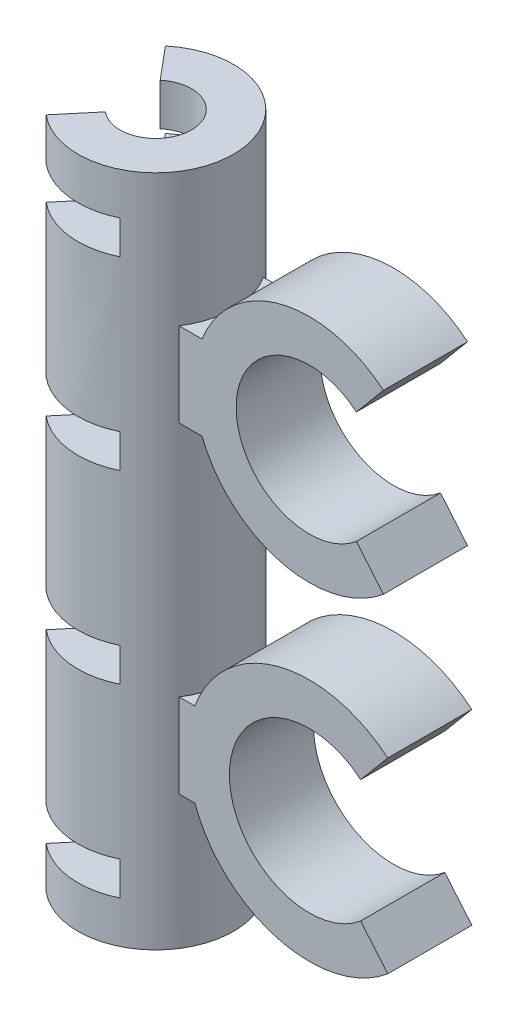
ISO-10303-21;
HEADER;
FILE_DESCRIPTION(('STEP AP214'),'2;1');
FILE_NAME('part.step','',(''),(''),'','','');
FILE_SCHEMA(('AUTOMOTIVE_DESIGN { 1 0 10303 214 1 1 1 1 }'));
ENDSEC;
DATA;
#1=APPLICATION_CONTEXT('core data for automotive mechanical design processes');
#2=APPLICATION_PROTOCOL_DEFINITION('international standard','automotive_design',2000,#1);
#3=PRODUCT_CONTEXT('',#1,'mechanical');
#4=PRODUCT('Part','Part','',(#3));
#5=PRODUCT_RELATED_PRODUCT_CATEGORY('part','',(#4));
#6=PRODUCT_DEFINITION_FORMATION('','',#4);
#7=PRODUCT_DEFINITION_CONTEXT('part definition',#1,'design');
#8=PRODUCT_DEFINITION('design','',#6,#7);
#9=PRODUCT_DEFINITION_SHAPE('','',#8);
#10=(LENGTH_UNIT() NAMED_UNIT(*) SI_UNIT(.MILLI.,.METRE.));
#11=(NAMED_UNIT(*) PLANE_ANGLE_UNIT() SI_UNIT($,.RADIAN.));
#12=(NAMED_UNIT(*) SI_UNIT($,.STERADIAN.) SOLID_ANGLE_UNIT());
#13=UNCERTAINTY_MEASURE_WITH_UNIT(LENGTH_MEASURE(1.E-05),#10,'distance_accuracy_value','');
#14=(GEOMETRIC_REPRESENTATION_CONTEXT(3) GLOBAL_UNCERTAINTY_ASSIGNED_CONTEXT((#13)) GLOBAL_UNIT_ASSIGNED_CONTEXT((#10,
#11,#12)) REPRESENTATION_CONTEXT('',''));
#15=CARTESIAN_POINT('',(0.,0.,0.));
#16=DIRECTION('',(0.,0.,1.));
#17=DIRECTION('',(1.,0.,0.));
#18=AXIS2_PLACEMENT_3D('',#15,#16,#17);
#19=CARTESIAN_POINT('',(0.,40.,0.));
#20=DIRECTION('',(0.,-1.,0.));
#21=DIRECTION('',(0.,0.,-1.));
#22=AXIS2_PLACEMENT_3D('',#19,#20,#21);
#23=CYLINDRICAL_SURFACE('',#22,4.25);
#24=CARTESIAN_POINT('',(0.,31.,0.));
#25=DIRECTION('',(0.,1.,0.));
#26=DIRECTION('',(-1.,0.,0.));
#27=AXIS2_PLACEMENT_3D('',#24,#25,#26);
#28=CIRCLE('',#27,4.25);
#29=CARTESIAN_POINT('',(-2.73184734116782,31.,-3.25568888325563));
#30=VERTEX_POINT('',#29);
#31=CARTESIAN_POINT('',(4.05421461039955,31.,-1.27508583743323));
#32=VERTEX_POINT('',#31);
#33=EDGE_CURVE('E941',#30,#32,#28,.F.);
#34=ORIENTED_EDGE('',*,*,#33,.F.);
#35=DIRECTION('',(0.,-1.,0.));
#36=VECTOR('',#35,1.);
#37=CARTESIAN_POINT('',(-2.73184734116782,40.,-3.25568888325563));
#38=LINE('',#37,#36);
#39=CARTESIAN_POINT('',(-2.73184734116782,13.,-3.25568888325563));
#40=VERTEX_POINT('',#39);
#41=EDGE_CURVE('E894',#30,#40,#38,.T.);
#42=ORIENTED_EDGE('',*,*,#41,.T.);
#43=CARTESIAN_POINT('',(0.,13.,0.));
#44=DIRECTION('',(0.,-1.,0.));
#45=DIRECTION('',(1.,0.,0.));
#46=AXIS2_PLACEMENT_3D('',#43,#44,#45);
#47=CIRCLE('',#46,4.25);
#48=CARTESIAN_POINT('',(4.05421461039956,13.,-1.27508583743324));
#49=VERTEX_POINT('',#48);
#50=EDGE_CURVE('E581',#49,#40,#47,.F.);
#51=ORIENTED_EDGE('',*,*,#50,.F.);
#52=DIRECTION('',(0.,-1.,0.));
#53=VECTOR('',#52,1.);
#54=CARTESIAN_POINT('',(4.05421461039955,40.,-1.27508583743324));
#55=LINE('',#54,#53);
#56=CARTESIAN_POINT('',(4.05421461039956,9.,-1.27508583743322));
#57=VERTEX_POINT('',#56);
#58=EDGE_CURVE('E696',#57,#49,#55,.F.);
#59=ORIENTED_EDGE('',*,*,#58,.F.);
#60=CARTESIAN_POINT('',(0.,9.,0.));
#61=DIRECTION('',(0.,1.,0.));
#62=DIRECTION('',(-1.,0.,0.));
#63=AXIS2_PLACEMENT_3D('',#60,#61,#62);
#64=CIRCLE('',#63,4.25);
#65=CARTESIAN_POINT('',(-2.73184734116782,9.,-3.25568888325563));
#66=VERTEX_POINT('',#65);
#67=EDGE_CURVE('E600',#66,#57,#64,.F.);
#68=ORIENTED_EDGE('',*,*,#67,.F.);
#69=CARTESIAN_POINT('',(-2.73184734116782,-9.,-3.25568888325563));
#70=VERTEX_POINT('',#69);
#71=EDGE_CURVE('E891',#66,#70,#38,.T.);
#72=ORIENTED_EDGE('',*,*,#71,.T.);
#73=CARTESIAN_POINT('',(0.,-9.,0.));
#74=DIRECTION('',(0.,-1.,0.));
#75=DIRECTION('',(1.,0.,0.));
#76=AXIS2_PLACEMENT_3D('',#73,#74,#75);
#77=CIRCLE('',#76,4.25);
#78=CARTESIAN_POINT('',(4.05421461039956,-9.,-1.27508583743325));
#79=VERTEX_POINT('',#78);
#80=EDGE_CURVE('E623',#79,#70,#77,.F.);
#81=ORIENTED_EDGE('',*,*,#80,.F.);
#82=DIRECTION('',(0.,-1.,0.));
#83=VECTOR('',#82,1.);
#84=CARTESIAN_POINT('',(4.05421461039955,40.,-1.27508583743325));
#85=LINE('',#84,#83);
#86=CARTESIAN_POINT('',(4.05421461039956,-13.,-1.27508583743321));
#87=VERTEX_POINT('',#86);
#88=EDGE_CURVE('E711',#87,#79,#85,.F.);
#89=ORIENTED_EDGE('',*,*,#88,.F.);
#90=CARTESIAN_POINT('',(0.,-13.,0.));
#91=DIRECTION('',(0.,1.,0.));
#92=DIRECTION('',(0.,0.,1.));
#93=AXIS2_PLACEMENT_3D('',#90,#91,#92);
#94=CIRCLE('',#93,4.25);
#95=CARTESIAN_POINT('',(-2.73184734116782,-13.,-3.25568888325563));
#96=VERTEX_POINT('',#95);
#97=EDGE_CURVE('E636',#96,#87,#94,.F.);
#98=ORIENTED_EDGE('',*,*,#97,.F.);
#99=CARTESIAN_POINT('',(-2.73184734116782,-31.,-3.25568888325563));
#100=VERTEX_POINT('',#99);
#101=EDGE_CURVE('E889',#96,#100,#38,.T.);
#102=ORIENTED_EDGE('',*,*,#101,.T.);
#103=CARTESIAN_POINT('',(0.,-31.,0.));
#104=DIRECTION('',(0.,-1.,0.));
#105=DIRECTION('',(1.,0.,0.));
#106=AXIS2_PLACEMENT_3D('',#103,#104,#105);
#107=CIRCLE('',#106,4.25);
#108=CARTESIAN_POINT('',(4.05421461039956,-31.,-1.27508583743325));
#109=VERTEX_POINT('',#108);
#110=EDGE_CURVE('E430',#109,#100,#107,.F.);
#111=ORIENTED_EDGE('',*,*,#110,.F.);
#112=DIRECTION('',(0.,-1.,0.));
#113=VECTOR('',#112,1.);
#114=CARTESIAN_POINT('',(4.05421461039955,40.,-1.27508583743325));
#115=LINE('',#114,#113);
#116=CARTESIAN_POINT('',(4.05421461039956,-35.,-1.2750858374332));
#117=VERTEX_POINT('',#116);
#118=EDGE_CURVE('E919',#117,#109,#115,.F.);
#119=ORIENTED_EDGE('',*,*,#118,.F.);
#120=CARTESIAN_POINT('',(0.,-35.,0.));
#121=DIRECTION('',(0.,1.,0.));
#122=DIRECTION('',(0.,0.,1.));
#123=AXIS2_PLACEMENT_3D('',#120,#121,#122);
#124=CIRCLE('',#123,4.25);
#125=CARTESIAN_POINT('',(-2.73184734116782,-35.,-3.25568888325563));
#126=VERTEX_POINT('',#125);
#127=EDGE_CURVE('E653',#126,#117,#124,.F.);
#128=ORIENTED_EDGE('',*,*,#127,.F.);
#129=CARTESIAN_POINT('',(-2.73184734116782,-40.,-3.25568888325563));
#130=VERTEX_POINT('',#129);
#131=EDGE_CURVE('E860',#126,#130,#38,.T.);
#132=ORIENTED_EDGE('',*,*,#131,.T.);
#133=CARTESIAN_POINT('',(0.,-40.,0.));
#134=DIRECTION('',(0.,-1.,0.));
#135=DIRECTION('',(0.,0.,1.));
#136=AXIS2_PLACEMENT_3D('',#133,#134,#135);
#137=CIRCLE('',#136,4.25);
#138=CARTESIAN_POINT('',(-2.73184734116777,-40.,3.25568888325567));
#139=VERTEX_POINT('',#138);
#140=EDGE_CURVE('E845',#130,#139,#137,.T.);
#141=ORIENTED_EDGE('',*,*,#140,.T.);
#142=DIRECTION('',(0.,-1.,0.));
#143=VECTOR('',#142,1.);
#144=CARTESIAN_POINT('',(-2.73184734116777,40.,3.25568888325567));
#145=LINE('',#144,#143);
#146=CARTESIAN_POINT('',(-2.73184734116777,-35.,3.25568888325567));
#147=VERTEX_POINT('',#146);
#148=EDGE_CURVE('E465',#147,#139,#145,.T.);
#149=ORIENTED_EDGE('',*,*,#148,.F.);
#150=CARTESIAN_POINT('',(4.05421461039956,-35.,1.2750858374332));
#151=VERTEX_POINT('',#150);
#152=EDGE_CURVE('E647',#151,#147,#124,.F.);
#153=ORIENTED_EDGE('',*,*,#152,.F.);
#154=DIRECTION('',(0.,-1.,0.));
#155=VECTOR('',#154,1.);
#156=CARTESIAN_POINT('',(4.05421461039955,40.,1.27508583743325));
#157=LINE('',#156,#155);
#158=CARTESIAN_POINT('',(4.05421461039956,-31.,1.27508583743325));
#159=VERTEX_POINT('',#158);
#160=EDGE_CURVE('E963',#159,#151,#157,.T.);
#161=ORIENTED_EDGE('',*,*,#160,.F.);
#162=CARTESIAN_POINT('',(-2.73184734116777,-31.,3.25568888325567));
#163=VERTEX_POINT('',#162);
#164=EDGE_CURVE('E645',#163,#159,#107,.F.);
#165=ORIENTED_EDGE('',*,*,#164,.F.);
#166=CARTESIAN_POINT('',(-2.73184734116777,-13.,3.25568888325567));
#167=VERTEX_POINT('',#166);
#168=EDGE_CURVE('E985',#167,#163,#145,.T.);
#169=ORIENTED_EDGE('',*,*,#168,.F.);
#170=CARTESIAN_POINT('',(4.05421461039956,-13.,1.27508583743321));
#171=VERTEX_POINT('',#170);
#172=EDGE_CURVE('E630',#171,#167,#94,.F.);
#173=ORIENTED_EDGE('',*,*,#172,.F.);
#174=DIRECTION('',(0.,-1.,0.));
#175=VECTOR('',#174,1.);
#176=CARTESIAN_POINT('',(4.05421461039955,40.,1.27508583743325));
#177=LINE('',#176,#175);
#178=CARTESIAN_POINT('',(4.05421461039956,-9.,1.27508583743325));
#179=VERTEX_POINT('',#178);
#180=EDGE_CURVE('E969',#179,#171,#177,.T.);
#181=ORIENTED_EDGE('',*,*,#180,.F.);
#182=CARTESIAN_POINT('',(-2.73184734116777,-9.,3.25568888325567));
#183=VERTEX_POINT('',#182);
#184=EDGE_CURVE('E617',#183,#179,#77,.F.);
#185=ORIENTED_EDGE('',*,*,#184,.F.);
#186=CARTESIAN_POINT('',(-2.73184734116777,9.,3.25568888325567));
#187=VERTEX_POINT('',#186);
#188=EDGE_CURVE('E990',#187,#183,#145,.T.);
#189=ORIENTED_EDGE('',*,*,#188,.F.);
#190=CARTESIAN_POINT('',(4.05421461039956,9.,1.27508583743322));
#191=VERTEX_POINT('',#190);
#192=EDGE_CURVE('E591',#191,#187,#64,.F.);
#193=ORIENTED_EDGE('',*,*,#192,.F.);
#194=DIRECTION('',(0.,-1.,0.));
#195=VECTOR('',#194,1.);
#196=CARTESIAN_POINT('',(4.05421461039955,40.,1.27508583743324));
#197=LINE('',#196,#195);
#198=CARTESIAN_POINT('',(4.05421461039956,13.,1.27508583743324));
#199=VERTEX_POINT('',#198);
#200=EDGE_CURVE('E705',#199,#191,#197,.T.);
#201=ORIENTED_EDGE('',*,*,#200,.F.);
#202=CARTESIAN_POINT('',(-2.73184734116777,13.,3.25568888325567));
#203=VERTEX_POINT('',#202);
#204=EDGE_CURVE('E574',#203,#199,#47,.F.);
#205=ORIENTED_EDGE('',*,*,#204,.F.);
#206=CARTESIAN_POINT('',(-2.73184734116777,31.,3.25568888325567));
#207=VERTEX_POINT('',#206);
#208=EDGE_CURVE('E472',#207,#203,#145,.T.);
#209=ORIENTED_EDGE('',*,*,#208,.F.);
#210=CARTESIAN_POINT('',(4.05421461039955,31.,1.27508583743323));
#211=VERTEX_POINT('',#210);
#212=EDGE_CURVE('E955',#211,#207,#28,.F.);
#213=ORIENTED_EDGE('',*,*,#212,.F.);
#214=DIRECTION('',(0.,-1.,0.));
#215=VECTOR('',#214,1.);
#216=CARTESIAN_POINT('',(4.05421461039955,40.,1.27508583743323));
#217=LINE('',#216,#215);
#218=CARTESIAN_POINT('',(4.05421461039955,35.,1.27508583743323));
#219=VERTEX_POINT('',#218);
#220=EDGE_CURVE('E704',#219,#211,#217,.T.);
#221=ORIENTED_EDGE('',*,*,#220,.F.);
#222=CARTESIAN_POINT('',(0.,35.,0.));
#223=DIRECTION('',(0.,-1.,0.));
#224=DIRECTION('',(0.,0.,-1.));
#225=AXIS2_PLACEMENT_3D('',#222,#223,#224);
#226=CIRCLE('',#225,4.25);
#227=CARTESIAN_POINT('',(-2.73184734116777,35.,3.25568888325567));
#228=VERTEX_POINT('',#227);
#229=EDGE_CURVE('E556',#228,#219,#226,.F.);
#230=ORIENTED_EDGE('',*,*,#229,.F.);
#231=CARTESIAN_POINT('',(-2.73184734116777,40.,3.25568888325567));
#232=VERTEX_POINT('',#231);
#233=EDGE_CURVE('E467',#232,#228,#145,.T.);
#234=ORIENTED_EDGE('',*,*,#233,.F.);
#235=CARTESIAN_POINT('',(0.,40.,0.));
#236=DIRECTION('',(0.,-1.,0.));
#237=DIRECTION('',(0.,0.,1.));
#238=AXIS2_PLACEMENT_3D('',#235,#236,#237);
#239=CIRCLE('',#238,4.25);
#240=CARTESIAN_POINT('',(-2.73184734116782,40.,-3.25568888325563));
#241=VERTEX_POINT('',#240);
#242=EDGE_CURVE('E846',#241,#232,#239,.T.);
#243=ORIENTED_EDGE('',*,*,#242,.F.);
#244=CARTESIAN_POINT('',(-2.73184734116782,35.,-3.25568888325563));
#245=VERTEX_POINT('',#244);
#246=EDGE_CURVE('E453',#241,#245,#38,.T.);
#247=ORIENTED_EDGE('',*,*,#246,.T.);
#248=CARTESIAN_POINT('',(4.05421461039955,35.,-1.27508583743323));
#249=VERTEX_POINT('',#248);
#250=EDGE_CURVE('E565',#249,#245,#226,.F.);
#251=ORIENTED_EDGE('',*,*,#250,.F.);
#252=DIRECTION('',(0.,-1.,0.));
#253=VECTOR('',#252,1.);
#254=CARTESIAN_POINT('',(4.05421461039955,40.,-1.27508583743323));
#255=LINE('',#254,#253);
#256=EDGE_CURVE('E709',#32,#249,#255,.F.);
#257=ORIENTED_EDGE('',*,*,#256,.F.);
#258=EDGE_LOOP('',(#34,#42,#51,#59,#68,#72,#81,#89,#98,#102,#111,#119,#128,#132,#141,#149,#153,
#161,#165,#169,#173,#181,#185,#189,#193,#201,#205,#209,#213,#221,#230,#234,#243,#247,#251,#257));
#259=FACE_BOUND('',#258,.T.);
#260=ADVANCED_FACE('F89',(#259),#23,.F.);
#261=CARTESIAN_POINT('',(-5.94578538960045,40.,7.08591109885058));
#262=DIRECTION('',(0.766044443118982,0.,0.642787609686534));
#263=DIRECTION('',(0.642787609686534,0.,-0.766044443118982));
#264=AXIS2_PLACEMENT_3D('',#261,#262,#263);
#265=PLANE('',#264);
#266=DIRECTION('',(-0.642787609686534,0.,0.766044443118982));
#267=VECTOR('',#266,1.);
#268=CARTESIAN_POINT('',(-5.94578538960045,31.,7.08591109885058));
#269=LINE('',#268,#267);
#270=CARTESIAN_POINT('',(-5.94578538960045,31.,7.08591109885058));
#271=VERTEX_POINT('',#270);
#272=EDGE_CURVE('E957',#207,#271,#269,.T.);
#273=ORIENTED_EDGE('',*,*,#272,.F.);
#274=ORIENTED_EDGE('',*,*,#208,.T.);
#275=DIRECTION('',(0.642787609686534,0.,-0.766044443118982));
#276=VECTOR('',#275,1.);
#277=CARTESIAN_POINT('',(-5.94578538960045,13.,7.08591109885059));
#278=LINE('',#277,#276);
#279=CARTESIAN_POINT('',(-5.94578538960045,13.,7.08591109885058));
#280=VERTEX_POINT('',#279);
#281=EDGE_CURVE('E579',#280,#203,#278,.T.);
#282=ORIENTED_EDGE('',*,*,#281,.F.);
#283=DIRECTION('',(0.,-1.,0.));
#284=VECTOR('',#283,1.);
#285=CARTESIAN_POINT('',(-5.94578538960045,40.,7.08591109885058));
#286=LINE('',#285,#284);
#287=EDGE_CURVE('E466',#271,#280,#286,.T.);
#288=ORIENTED_EDGE('',*,*,#287,.F.);
#289=EDGE_LOOP('',(#273,#274,#282,#288));
#290=FACE_BOUND('',#289,.T.);
#291=ADVANCED_FACE('F1030',(#290),#265,.F.);
#292=DIRECTION('',(0.642787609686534,0.,-0.766044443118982));
#293=VECTOR('',#292,1.);
#294=CARTESIAN_POINT('',(-5.94578538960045,35.,7.08591109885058));
#295=LINE('',#294,#293);
#296=CARTESIAN_POINT('',(-5.94578538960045,35.,7.08591109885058));
#297=VERTEX_POINT('',#296);
#298=EDGE_CURVE('E564',#297,#228,#295,.T.);
#299=ORIENTED_EDGE('',*,*,#298,.F.);
#300=CARTESIAN_POINT('',(-5.94578538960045,40.,7.08591109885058));
#301=VERTEX_POINT('',#300);
#302=EDGE_CURVE('E461',#301,#297,#286,.T.);
#303=ORIENTED_EDGE('',*,*,#302,.F.);
#304=DIRECTION('',(-0.642787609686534,0.,0.766044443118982));
#305=VECTOR('',#304,1.);
#306=CARTESIAN_POINT('',(-5.94578538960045,40.,7.08591109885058));
#307=LINE('',#306,#305);
#308=EDGE_CURVE('E850',#232,#301,#307,.T.);
#309=ORIENTED_EDGE('',*,*,#308,.F.);
#310=ORIENTED_EDGE('',*,*,#233,.T.);
#311=EDGE_LOOP('',(#299,#303,#309,#310));
#312=FACE_BOUND('',#311,.T.);
#313=ADVANCED_FACE('F1034',(#312),#265,.F.);
#314=DIRECTION('',(-0.642787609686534,0.,0.766044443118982));
#315=VECTOR('',#314,1.);
#316=CARTESIAN_POINT('',(-5.94578538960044,9.,7.08591109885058));
#317=LINE('',#316,#315);
#318=CARTESIAN_POINT('',(-5.94578538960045,9.,7.08591109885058));
#319=VERTEX_POINT('',#318);
#320=EDGE_CURVE('E598',#187,#319,#317,.T.);
#321=ORIENTED_EDGE('',*,*,#320,.F.);
#322=ORIENTED_EDGE('',*,*,#188,.T.);
#323=DIRECTION('',(0.642787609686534,0.,-0.766044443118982));
#324=VECTOR('',#323,1.);
#325=CARTESIAN_POINT('',(-5.94578538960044,-9.,7.08591109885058));
#326=LINE('',#325,#324);
#327=CARTESIAN_POINT('',(-5.94578538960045,-9.,7.08591109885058));
#328=VERTEX_POINT('',#327);
#329=EDGE_CURVE('E621',#328,#183,#326,.T.);
#330=ORIENTED_EDGE('',*,*,#329,.F.);
#331=EDGE_CURVE('E1010',#319,#328,#286,.T.);
#332=ORIENTED_EDGE('',*,*,#331,.F.);
#333=EDGE_LOOP('',(#321,#322,#330,#332));
#334=FACE_BOUND('',#333,.T.);
#335=ADVANCED_FACE('F1039',(#334),#265,.F.);
#336=DIRECTION('',(-0.642787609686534,0.,0.766044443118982));
#337=VECTOR('',#336,1.);
#338=CARTESIAN_POINT('',(-5.94578538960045,-13.,7.08591109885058));
#339=LINE('',#338,#337);
#340=CARTESIAN_POINT('',(-5.94578538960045,-13.,7.08591109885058));
#341=VERTEX_POINT('',#340);
#342=EDGE_CURVE('E633',#167,#341,#339,.T.);
#343=ORIENTED_EDGE('',*,*,#342,.F.);
#344=ORIENTED_EDGE('',*,*,#168,.T.);
#345=DIRECTION('',(0.642787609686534,0.,-0.766044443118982));
#346=VECTOR('',#345,1.);
#347=CARTESIAN_POINT('',(-5.94578538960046,-31.,7.0859110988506));
#348=LINE('',#347,#346);
#349=CARTESIAN_POINT('',(-5.94578538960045,-31.,7.08591109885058));
#350=VERTEX_POINT('',#349);
#351=EDGE_CURVE('E642',#350,#163,#348,.T.);
#352=ORIENTED_EDGE('',*,*,#351,.F.);
#353=EDGE_CURVE('E1008',#341,#350,#286,.T.);
#354=ORIENTED_EDGE('',*,*,#353,.F.);
#355=EDGE_LOOP('',(#343,#344,#352,#354));
#356=FACE_BOUND('',#355,.T.);
#357=ADVANCED_FACE('F1043',(#356),#265,.F.);
#358=DIRECTION('',(-0.642787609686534,0.,0.766044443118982));
#359=VECTOR('',#358,1.);
#360=CARTESIAN_POINT('',(-5.94578538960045,-35.,7.08591109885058));
#361=LINE('',#360,#359);
#362=CARTESIAN_POINT('',(-5.94578538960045,-35.,7.08591109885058));
#363=VERTEX_POINT('',#362);
#364=EDGE_CURVE('E650',#147,#363,#361,.T.);
#365=ORIENTED_EDGE('',*,*,#364,.F.);
#366=ORIENTED_EDGE('',*,*,#148,.T.);
#367=DIRECTION('',(-0.642787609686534,0.,0.766044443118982));
#368=VECTOR('',#367,1.);
#369=CARTESIAN_POINT('',(-5.94578538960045,-40.,7.08591109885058));
#370=LINE('',#369,#368);
#371=CARTESIAN_POINT('',(-5.94578538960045,-40.,7.08591109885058));
#372=VERTEX_POINT('',#371);
#373=EDGE_CURVE('E864',#139,#372,#370,.T.);
#374=ORIENTED_EDGE('',*,*,#373,.T.);
#375=EDGE_CURVE('E459',#363,#372,#286,.T.);
#376=ORIENTED_EDGE('',*,*,#375,.F.);
#377=EDGE_LOOP('',(#365,#366,#374,#376));
#378=FACE_BOUND('',#377,.T.);
#379=ADVANCED_FACE('F996',(#378),#265,.F.);
#380=CARTESIAN_POINT('',(0.,40.,0.));
#381=DIRECTION('',(0.,-1.,0.));
#382=DIRECTION('',(0.,0.,-1.));
#383=AXIS2_PLACEMENT_3D('',#380,#381,#382);
#384=CYLINDRICAL_SURFACE('',#383,9.25);
#385=CARTESIAN_POINT('',(0.,14.1,0.));
#386=DIRECTION('',(0.,1.,0.));
#387=DIRECTION('',(-1.,0.,0.));
#388=AXIS2_PLACEMENT_3D('',#385,#386,#387);
#389=CIRCLE('',#388,9.25);
#390=CARTESIAN_POINT('',(7.78219120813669,14.1,5.));
#391=VERTEX_POINT('',#390);
#392=CARTESIAN_POINT('',(7.78219120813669,14.1,-5.));
#393=VERTEX_POINT('',#392);
#394=EDGE_CURVE('E479',#391,#393,#389,.T.);
#395=ORIENTED_EDGE('',*,*,#394,.F.);
#396=DIRECTION('',(0.,-1.,0.));
#397=VECTOR('',#396,1.);
#398=CARTESIAN_POINT('',(7.78219120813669,40.,5.));
#399=LINE('',#398,#397);
#400=CARTESIAN_POINT('',(7.78219120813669,24.1,5.));
#401=VERTEX_POINT('',#400);
#402=EDGE_CURVE('E483',#391,#401,#399,.F.);
#403=ORIENTED_EDGE('',*,*,#402,.T.);
#404=CARTESIAN_POINT('',(0.,24.1,0.));
#405=DIRECTION('',(0.,1.,0.));
#406=DIRECTION('',(0.,0.,1.));
#407=AXIS2_PLACEMENT_3D('',#404,#405,#406);
#408=CIRCLE('',#407,9.25);
#409=CARTESIAN_POINT('',(7.78219120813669,24.1,-5.));
#410=VERTEX_POINT('',#409);
#411=EDGE_CURVE('E476',#401,#410,#408,.T.);
#412=ORIENTED_EDGE('',*,*,#411,.T.);
#413=DIRECTION('',(0.,-1.,0.));
#414=VECTOR('',#413,1.);
#415=CARTESIAN_POINT('',(7.78219120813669,40.,-5.));
#416=LINE('',#415,#414);
#417=EDGE_CURVE('E471',#393,#410,#416,.F.);
#418=ORIENTED_EDGE('',*,*,#417,.F.);
#419=EDGE_LOOP('',(#395,#403,#412,#418));
#420=FACE_BOUND('',#419,.T.);
#421=CARTESIAN_POINT('',(0.,-24.1,0.));
#422=DIRECTION('',(0.,1.,0.));
#423=DIRECTION('',(0.,0.,1.));
#424=AXIS2_PLACEMENT_3D('',#421,#422,#423);
#425=CIRCLE('',#424,9.25);
#426=CARTESIAN_POINT('',(7.78219120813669,-24.1,5.));
#427=VERTEX_POINT('',#426);
#428=CARTESIAN_POINT('',(7.78219120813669,-24.1,-5.));
#429=VERTEX_POINT('',#428);
#430=EDGE_CURVE('E493',#427,#429,#425,.T.);
#431=ORIENTED_EDGE('',*,*,#430,.F.);
#432=DIRECTION('',(0.,-1.,0.));
#433=VECTOR('',#432,1.);
#434=CARTESIAN_POINT('',(7.78219120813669,40.,5.));
#435=LINE('',#434,#433);
#436=CARTESIAN_POINT('',(7.78219120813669,-14.1,5.));
#437=VERTEX_POINT('',#436);
#438=EDGE_CURVE('E497',#427,#437,#435,.F.);
#439=ORIENTED_EDGE('',*,*,#438,.T.);
#440=CARTESIAN_POINT('',(0.,-14.1,0.));
#441=DIRECTION('',(0.,1.,0.));
#442=DIRECTION('',(-1.,0.,0.));
#443=AXIS2_PLACEMENT_3D('',#440,#441,#442);
#444=CIRCLE('',#443,9.25);
#445=CARTESIAN_POINT('',(7.78219120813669,-14.1,-5.));
#446=VERTEX_POINT('',#445);
#447=EDGE_CURVE('E490',#437,#446,#444,.T.);
#448=ORIENTED_EDGE('',*,*,#447,.T.);
#449=DIRECTION('',(0.,-1.,0.));
#450=VECTOR('',#449,1.);
#451=CARTESIAN_POINT('',(7.78219120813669,40.,-5.));
#452=LINE('',#451,#450);
#453=EDGE_CURVE('E486',#429,#446,#452,.F.);
#454=ORIENTED_EDGE('',*,*,#453,.F.);
#455=EDGE_LOOP('',(#431,#439,#448,#454));
#456=FACE_BOUND('',#455,.T.);
#457=CARTESIAN_POINT('',(0.,31.,0.));
#458=DIRECTION('',(0.,1.,0.));
#459=DIRECTION('',(-1.,0.,0.));
#460=AXIS2_PLACEMENT_3D('',#457,#458,#459);
#461=CIRCLE('',#460,9.25);
#462=CARTESIAN_POINT('',(4.05421461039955,31.,-8.31419532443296));
#463=VERTEX_POINT('',#462);
#464=CARTESIAN_POINT('',(-5.94578538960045,31.,-7.08591109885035));
#465=VERTEX_POINT('',#464);
#466=EDGE_CURVE('E946',#463,#465,#461,.T.);
#467=ORIENTED_EDGE('',*,*,#466,.F.);
#468=DIRECTION('',(0.,-1.,0.));
#469=VECTOR('',#468,1.);
#470=CARTESIAN_POINT('',(4.05421461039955,40.,-8.31419532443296));
#471=LINE('',#470,#469);
#472=CARTESIAN_POINT('',(4.05421461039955,35.,-8.31419532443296));
#473=VERTEX_POINT('',#472);
#474=EDGE_CURVE('E12',#473,#463,#471,.T.);
#475=ORIENTED_EDGE('',*,*,#474,.F.);
#476=CARTESIAN_POINT('',(0.,35.,0.));
#477=DIRECTION('',(0.,-1.,0.));
#478=DIRECTION('',(0.,0.,-1.));
#479=AXIS2_PLACEMENT_3D('',#476,#477,#478);
#480=CIRCLE('',#479,9.25);
#481=CARTESIAN_POINT('',(-5.94578538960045,35.,-7.08591109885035));
#482=VERTEX_POINT('',#481);
#483=EDGE_CURVE('E567',#482,#473,#480,.T.);
#484=ORIENTED_EDGE('',*,*,#483,.F.);
#485=DIRECTION('',(0.,-1.,0.));
#486=VECTOR('',#485,1.);
#487=CARTESIAN_POINT('',(-5.94578538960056,40.,-7.08591109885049));
#488=LINE('',#487,#486);
#489=CARTESIAN_POINT('',(-5.94578538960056,40.,-7.08591109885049));
#490=VERTEX_POINT('',#489);
#491=EDGE_CURVE('E454',#490,#482,#488,.T.);
#492=ORIENTED_EDGE('',*,*,#491,.F.);
#493=CARTESIAN_POINT('',(0.,40.,0.));
#494=DIRECTION('',(0.,1.,0.));
#495=DIRECTION('',(0.,0.,1.));
#496=AXIS2_PLACEMENT_3D('',#493,#494,#495);
#497=CIRCLE('',#496,9.25);
#498=EDGE_CURVE('E854',#301,#490,#497,.T.);
#499=ORIENTED_EDGE('',*,*,#498,.F.);
#500=ORIENTED_EDGE('',*,*,#302,.T.);
#501=CARTESIAN_POINT('',(4.05421461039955,35.,8.31419532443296));
#502=VERTEX_POINT('',#501);
#503=EDGE_CURVE('E553',#502,#297,#480,.T.);
#504=ORIENTED_EDGE('',*,*,#503,.F.);
#505=DIRECTION('',(0.,-1.,0.));
#506=VECTOR('',#505,1.);
#507=CARTESIAN_POINT('',(4.05421461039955,40.,8.31419532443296));
#508=LINE('',#507,#506);
#509=CARTESIAN_POINT('',(4.05421461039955,31.,8.31419532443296));
#510=VERTEX_POINT('',#509);
#511=EDGE_CURVE('E97',#510,#502,#508,.F.);
#512=ORIENTED_EDGE('',*,*,#511,.F.);
#513=EDGE_CURVE('E951',#271,#510,#461,.T.);
#514=ORIENTED_EDGE('',*,*,#513,.F.);
#515=ORIENTED_EDGE('',*,*,#287,.T.);
#516=CARTESIAN_POINT('',(0.,13.,0.));
#517=DIRECTION('',(0.,-1.,0.));
#518=DIRECTION('',(1.,0.,0.));
#519=AXIS2_PLACEMENT_3D('',#516,#517,#518);
#520=CIRCLE('',#519,9.25);
#521=CARTESIAN_POINT('',(4.05421461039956,13.,8.31419532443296));
#522=VERTEX_POINT('',#521);
#523=EDGE_CURVE('E587',#522,#280,#520,.T.);
#524=ORIENTED_EDGE('',*,*,#523,.F.);
#525=DIRECTION('',(0.,-1.,0.));
#526=VECTOR('',#525,1.);
#527=CARTESIAN_POINT('',(4.05421461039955,40.,8.31419532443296));
#528=LINE('',#527,#526);
#529=CARTESIAN_POINT('',(4.05421461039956,9.,8.31419532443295));
#530=VERTEX_POINT('',#529);
#531=EDGE_CURVE('E533',#530,#522,#528,.F.);
#532=ORIENTED_EDGE('',*,*,#531,.F.);
#533=CARTESIAN_POINT('',(0.,9.,0.));
#534=DIRECTION('',(0.,1.,0.));
#535=DIRECTION('',(-1.,0.,0.));
#536=AXIS2_PLACEMENT_3D('',#533,#534,#535);
#537=CIRCLE('',#536,9.25);
#538=EDGE_CURVE('E606',#319,#530,#537,.T.);
#539=ORIENTED_EDGE('',*,*,#538,.F.);
#540=ORIENTED_EDGE('',*,*,#331,.T.);
#541=CARTESIAN_POINT('',(0.,-9.,0.));
#542=DIRECTION('',(0.,-1.,0.));
#543=DIRECTION('',(1.,0.,0.));
#544=AXIS2_PLACEMENT_3D('',#541,#542,#543);
#545=CIRCLE('',#544,9.25);
#546=CARTESIAN_POINT('',(4.05421461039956,-9.,8.31419532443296));
#547=VERTEX_POINT('',#546);
#548=EDGE_CURVE('E626',#547,#328,#545,.T.);
#549=ORIENTED_EDGE('',*,*,#548,.F.);
#550=DIRECTION('',(0.,-1.,0.));
#551=VECTOR('',#550,1.);
#552=CARTESIAN_POINT('',(4.05421461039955,40.,8.31419532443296));
#553=LINE('',#552,#551);
#554=CARTESIAN_POINT('',(4.05421461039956,-13.,8.31419532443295));
#555=VERTEX_POINT('',#554);
#556=EDGE_CURVE('E530',#555,#547,#553,.F.);
#557=ORIENTED_EDGE('',*,*,#556,.F.);
#558=CARTESIAN_POINT('',(0.,-13.,0.));
#559=DIRECTION('',(0.,1.,0.));
#560=DIRECTION('',(0.,0.,1.));
#561=AXIS2_PLACEMENT_3D('',#558,#559,#560);
#562=CIRCLE('',#561,9.25);
#563=EDGE_CURVE('E111',#341,#555,#562,.T.);
#564=ORIENTED_EDGE('',*,*,#563,.F.);
#565=ORIENTED_EDGE('',*,*,#353,.T.);
#566=CARTESIAN_POINT('',(0.,-31.,0.));
#567=DIRECTION('',(0.,-1.,0.));
#568=DIRECTION('',(1.,0.,0.));
#569=AXIS2_PLACEMENT_3D('',#566,#567,#568);
#570=CIRCLE('',#569,9.25);
#571=CARTESIAN_POINT('',(4.05421461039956,-31.,8.31419532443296));
#572=VERTEX_POINT('',#571);
#573=EDGE_CURVE('E429',#572,#350,#570,.T.);
#574=ORIENTED_EDGE('',*,*,#573,.F.);
#575=DIRECTION('',(0.,-1.,0.));
#576=VECTOR('',#575,1.);
#577=CARTESIAN_POINT('',(4.05421461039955,40.,8.31419532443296));
#578=LINE('',#577,#576);
#579=CARTESIAN_POINT('',(4.05421461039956,-35.,8.31419532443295));
#580=VERTEX_POINT('',#579);
#581=EDGE_CURVE('E524',#580,#572,#578,.F.);
#582=ORIENTED_EDGE('',*,*,#581,.F.);
#583=CARTESIAN_POINT('',(0.,-35.,0.));
#584=DIRECTION('',(0.,1.,0.));
#585=DIRECTION('',(0.,0.,1.));
#586=AXIS2_PLACEMENT_3D('',#583,#584,#585);
#587=CIRCLE('',#586,9.25);
#588=EDGE_CURVE('E104',#363,#580,#587,.T.);
#589=ORIENTED_EDGE('',*,*,#588,.F.);
#590=ORIENTED_EDGE('',*,*,#375,.T.);
#591=CARTESIAN_POINT('',(0.,-40.,0.));
#592=DIRECTION('',(0.,1.,0.));
#593=DIRECTION('',(0.,0.,1.));
#594=AXIS2_PLACEMENT_3D('',#591,#592,#593);
#595=CIRCLE('',#594,9.25);
#596=CARTESIAN_POINT('',(-5.94578538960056,-40.,-7.08591109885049));
#597=VERTEX_POINT('',#596);
#598=EDGE_CURVE('E868',#372,#597,#595,.T.);
#599=ORIENTED_EDGE('',*,*,#598,.T.);
#600=CARTESIAN_POINT('',(-5.94578538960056,-35.,-7.08591109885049));
#601=VERTEX_POINT('',#600);
#602=EDGE_CURVE('E447',#601,#597,#488,.T.);
#603=ORIENTED_EDGE('',*,*,#602,.F.);
#604=CARTESIAN_POINT('',(4.05421461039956,-35.,-8.31419532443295));
#605=VERTEX_POINT('',#604);
#606=EDGE_CURVE('E656',#605,#601,#587,.T.);
#607=ORIENTED_EDGE('',*,*,#606,.F.);
#608=DIRECTION('',(0.,-1.,0.));
#609=VECTOR('',#608,1.);
#610=CARTESIAN_POINT('',(4.05421461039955,40.,-8.31419532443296));
#611=LINE('',#610,#609);
#612=CARTESIAN_POINT('',(4.05421461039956,-31.,-8.31419532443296));
#613=VERTEX_POINT('',#612);
#614=EDGE_CURVE('E424',#613,#605,#611,.T.);
#615=ORIENTED_EDGE('',*,*,#614,.F.);
#616=CARTESIAN_POINT('',(-5.94578538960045,-31.,-7.08591109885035));
#617=VERTEX_POINT('',#616);
#618=EDGE_CURVE('E416',#617,#613,#570,.T.);
#619=ORIENTED_EDGE('',*,*,#618,.F.);
#620=CARTESIAN_POINT('',(-5.94578538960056,-13.,-7.08591109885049));
#621=VERTEX_POINT('',#620);
#622=EDGE_CURVE('E422',#621,#617,#488,.T.);
#623=ORIENTED_EDGE('',*,*,#622,.F.);
#624=CARTESIAN_POINT('',(4.05421461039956,-13.,-8.31419532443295));
#625=VERTEX_POINT('',#624);
#626=EDGE_CURVE('E639',#625,#621,#562,.T.);
#627=ORIENTED_EDGE('',*,*,#626,.F.);
#628=DIRECTION('',(0.,-1.,0.));
#629=VECTOR('',#628,1.);
#630=CARTESIAN_POINT('',(4.05421461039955,40.,-8.31419532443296));
#631=LINE('',#630,#629);
#632=CARTESIAN_POINT('',(4.05421461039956,-9.,-8.31419532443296));
#633=VERTEX_POINT('',#632);
#634=EDGE_CURVE('E527',#633,#625,#631,.T.);
#635=ORIENTED_EDGE('',*,*,#634,.F.);
#636=CARTESIAN_POINT('',(-5.94578538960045,-9.,-7.08591109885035));
#637=VERTEX_POINT('',#636);
#638=EDGE_CURVE('E629',#637,#633,#545,.T.);
#639=ORIENTED_EDGE('',*,*,#638,.F.);
#640=CARTESIAN_POINT('',(-5.94578538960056,9.,-7.08591109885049));
#641=VERTEX_POINT('',#640);
#642=EDGE_CURVE('E446',#641,#637,#488,.T.);
#643=ORIENTED_EDGE('',*,*,#642,.F.);
#644=CARTESIAN_POINT('',(4.05421461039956,9.,-8.31419532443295));
#645=VERTEX_POINT('',#644);
#646=EDGE_CURVE('E610',#645,#641,#537,.T.);
#647=ORIENTED_EDGE('',*,*,#646,.F.);
#648=DIRECTION('',(0.,-1.,0.));
#649=VECTOR('',#648,1.);
#650=CARTESIAN_POINT('',(4.05421461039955,40.,-8.31419532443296));
#651=LINE('',#650,#649);
#652=CARTESIAN_POINT('',(4.05421461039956,13.,-8.31419532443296));
#653=VERTEX_POINT('',#652);
#654=EDGE_CURVE('E536',#653,#645,#651,.T.);
#655=ORIENTED_EDGE('',*,*,#654,.F.);
#656=CARTESIAN_POINT('',(-5.94578538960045,13.,-7.08591109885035));
#657=VERTEX_POINT('',#656);
#658=EDGE_CURVE('E590',#657,#653,#520,.T.);
#659=ORIENTED_EDGE('',*,*,#658,.F.);
#660=EDGE_CURVE('E452',#465,#657,#488,.T.);
#661=ORIENTED_EDGE('',*,*,#660,.F.);
#662=EDGE_LOOP('',(#467,#475,#484,#492,#499,#500,#504,#512,#514,#515,#524,#532,#539,#540,#549,
#557,#564,#565,#574,#582,#589,#590,#599,#603,#607,#615,#619,#623,#627,#635,#639,#643,#647,#655,
#659,#661));
#663=FACE_BOUND('',#662,.T.);
#664=ADVANCED_FACE('F419',(#420,#456,#663),#384,.T.);
#665=CARTESIAN_POINT('',(-2.73184734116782,40.,-3.25568888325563));
#666=DIRECTION('',(0.766044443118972,0.,-0.642787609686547));
#667=DIRECTION('',(-0.642787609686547,0.,-0.766044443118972));
#668=AXIS2_PLACEMENT_3D('',#665,#666,#667);
#669=PLANE('',#668);
#670=DIRECTION('',(0.642787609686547,0.,0.766044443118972));
#671=VECTOR('',#670,1.);
#672=CARTESIAN_POINT('',(-2.73184734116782,31.,-3.25568888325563));
#673=LINE('',#672,#671);
#674=EDGE_CURVE('E519',#465,#30,#673,.T.);
#675=ORIENTED_EDGE('',*,*,#674,.F.);
#676=ORIENTED_EDGE('',*,*,#660,.T.);
#677=DIRECTION('',(-0.642787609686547,0.,-0.766044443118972));
#678=VECTOR('',#677,1.);
#679=CARTESIAN_POINT('',(-2.73184734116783,13.,-3.25568888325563));
#680=LINE('',#679,#678);
#681=EDGE_CURVE('E511',#40,#657,#680,.T.);
#682=ORIENTED_EDGE('',*,*,#681,.F.);
#683=ORIENTED_EDGE('',*,*,#41,.F.);
#684=EDGE_LOOP('',(#675,#676,#682,#683));
#685=FACE_BOUND('',#684,.T.);
#686=ADVANCED_FACE('F1048',(#685),#669,.F.);
#687=DIRECTION('',(-0.642787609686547,0.,-0.766044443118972));
#688=VECTOR('',#687,1.);
#689=CARTESIAN_POINT('',(-2.73184734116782,35.,-3.25568888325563));
#690=LINE('',#689,#688);
#691=EDGE_CURVE('E515',#245,#482,#690,.T.);
#692=ORIENTED_EDGE('',*,*,#691,.F.);
#693=ORIENTED_EDGE('',*,*,#246,.F.);
#694=DIRECTION('',(0.642787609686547,0.,0.766044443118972));
#695=VECTOR('',#694,1.);
#696=CARTESIAN_POINT('',(-2.73184734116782,40.,-3.25568888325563));
#697=LINE('',#696,#695);
#698=EDGE_CURVE('E857',#490,#241,#697,.T.);
#699=ORIENTED_EDGE('',*,*,#698,.F.);
#700=ORIENTED_EDGE('',*,*,#491,.T.);
#701=EDGE_LOOP('',(#692,#693,#699,#700));
#702=FACE_BOUND('',#701,.T.);
#703=ADVANCED_FACE('F1184',(#702),#669,.F.);
#704=DIRECTION('',(0.642787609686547,0.,0.766044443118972));
#705=VECTOR('',#704,1.);
#706=CARTESIAN_POINT('',(-2.73184734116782,9.,-3.25568888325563));
#707=LINE('',#706,#705);
#708=EDGE_CURVE('E508',#641,#66,#707,.T.);
#709=ORIENTED_EDGE('',*,*,#708,.F.);
#710=ORIENTED_EDGE('',*,*,#642,.T.);
#711=DIRECTION('',(-0.642787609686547,0.,-0.766044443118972));
#712=VECTOR('',#711,1.);
#713=CARTESIAN_POINT('',(-2.73184734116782,-9.,-3.25568888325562));
#714=LINE('',#713,#712);
#715=EDGE_CURVE('E504',#70,#637,#714,.T.);
#716=ORIENTED_EDGE('',*,*,#715,.F.);
#717=ORIENTED_EDGE('',*,*,#71,.F.);
#718=EDGE_LOOP('',(#709,#710,#716,#717));
#719=FACE_BOUND('',#718,.T.);
#720=ADVANCED_FACE('F905',(#719),#669,.F.);
#721=DIRECTION('',(0.642787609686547,0.,0.766044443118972));
#722=VECTOR('',#721,1.);
#723=CARTESIAN_POINT('',(-2.73184734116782,-13.,-3.25568888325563));
#724=LINE('',#723,#722);
#725=EDGE_CURVE('E440',#621,#96,#724,.T.);
#726=ORIENTED_EDGE('',*,*,#725,.F.);
#727=ORIENTED_EDGE('',*,*,#622,.T.);
#728=DIRECTION('',(-0.642787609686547,0.,-0.766044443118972));
#729=VECTOR('',#728,1.);
#730=CARTESIAN_POINT('',(-2.73184734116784,-31.,-3.25568888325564));
#731=LINE('',#730,#729);
#732=EDGE_CURVE('E433',#100,#617,#731,.T.);
#733=ORIENTED_EDGE('',*,*,#732,.F.);
#734=ORIENTED_EDGE('',*,*,#101,.F.);
#735=EDGE_LOOP('',(#726,#727,#733,#734));
#736=FACE_BOUND('',#735,.T.);
#737=ADVANCED_FACE('F444',(#736),#669,.F.);
#738=DIRECTION('',(0.642787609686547,0.,0.766044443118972));
#739=VECTOR('',#738,1.);
#740=CARTESIAN_POINT('',(-2.73184734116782,-35.,-3.25568888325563));
#741=LINE('',#740,#739);
#742=EDGE_CURVE('E441',#601,#126,#741,.T.);
#743=ORIENTED_EDGE('',*,*,#742,.F.);
#744=ORIENTED_EDGE('',*,*,#602,.T.);
#745=DIRECTION('',(0.642787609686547,0.,0.766044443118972));
#746=VECTOR('',#745,1.);
#747=CARTESIAN_POINT('',(-2.73184734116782,-40.,-3.25568888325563));
#748=LINE('',#747,#746);
#749=EDGE_CURVE('E851',#597,#130,#748,.T.);
#750=ORIENTED_EDGE('',*,*,#749,.T.);
#751=ORIENTED_EDGE('',*,*,#131,.F.);
#752=EDGE_LOOP('',(#743,#744,#750,#751));
#753=FACE_BOUND('',#752,.T.);
#754=ADVANCED_FACE('F878',(#753),#669,.F.);
#755=CARTESIAN_POINT('',(0.,40.,0.));
#756=DIRECTION('',(0.,1.,0.));
#757=DIRECTION('',(0.,0.,1.));
#758=AXIS2_PLACEMENT_3D('',#755,#756,#757);
#759=PLANE('',#758);
#760=ORIENTED_EDGE('',*,*,#242,.T.);
#761=ORIENTED_EDGE('',*,*,#308,.T.);
#762=ORIENTED_EDGE('',*,*,#498,.T.);
#763=ORIENTED_EDGE('',*,*,#698,.T.);
#764=EDGE_LOOP('',(#760,#761,#762,#763));
#765=FACE_BOUND('',#764,.T.);
#766=ADVANCED_FACE('F1177',(#765),#759,.T.);
#767=CARTESIAN_POINT('',(0.,-40.,0.));
#768=DIRECTION('',(0.,1.,0.));
#769=DIRECTION('',(0.,0.,1.));
#770=AXIS2_PLACEMENT_3D('',#767,#768,#769);
#771=PLANE('',#770);
#772=ORIENTED_EDGE('',*,*,#140,.F.);
#773=ORIENTED_EDGE('',*,*,#749,.F.);
#774=ORIENTED_EDGE('',*,*,#598,.F.);
#775=ORIENTED_EDGE('',*,*,#373,.F.);
#776=EDGE_LOOP('',(#772,#773,#774,#775));
#777=FACE_BOUND('',#776,.T.);
#778=ADVANCED_FACE('F883',(#777),#771,.F.);
#779=CARTESIAN_POINT('',(0.,0.,5.));
#780=DIRECTION('',(0.,0.,1.));
#781=DIRECTION('',(1.,0.,0.));
#782=AXIS2_PLACEMENT_3D('',#779,#780,#781);
#783=PLANE('',#782);
#784=ORIENTED_EDGE('',*,*,#402,.F.);
#785=DIRECTION('',(1.,0.,0.));
#786=VECTOR('',#785,1.);
#787=CARTESIAN_POINT('',(0.,14.1,5.));
#788=LINE('',#787,#786);
#789=CARTESIAN_POINT('',(10.4950009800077,14.1,5.));
#790=VERTEX_POINT('',#789);
#791=EDGE_CURVE('E782',#391,#790,#788,.T.);
#792=ORIENTED_EDGE('',*,*,#791,.T.);
#793=CARTESIAN_POINT('',(23.2499999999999,19.1,5.));
#794=DIRECTION('',(0.,0.,1.));
#795=DIRECTION('',(1.,0.,0.));
#796=AXIS2_PLACEMENT_3D('',#793,#794,#795);
#797=CIRCLE('',#796,13.7);
#798=CARTESIAN_POINT('',(32.0561902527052,8.60519112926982,5.));
#799=VERTEX_POINT('',#798);
#800=EDGE_CURVE('E785',#790,#799,#797,.T.);
#801=ORIENTED_EDGE('',*,*,#800,.T.);
#802=DIRECTION('',(-0.642787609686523,0.766044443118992,0.));
#803=VECTOR('',#802,1.);
#804=CARTESIAN_POINT('',(23.048574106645,19.3400500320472,5.));
#805=LINE('',#804,#803);
#806=CARTESIAN_POINT('',(28.8422522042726,12.4354133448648,5.));
#807=VERTEX_POINT('',#806);
#808=EDGE_CURVE('E789',#799,#807,#805,.T.);
#809=ORIENTED_EDGE('',*,*,#808,.T.);
#810=CARTESIAN_POINT('',(23.2499999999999,19.1,5.));
#811=DIRECTION('',(0.,0.,1.));
#812=DIRECTION('',(1.,0.,0.));
#813=AXIS2_PLACEMENT_3D('',#810,#811,#812);
#814=CIRCLE('',#813,8.7);
#815=CARTESIAN_POINT('',(28.8422522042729,25.764586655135,5.));
#816=VERTEX_POINT('',#815);
#817=EDGE_CURVE('E793',#816,#807,#814,.T.);
#818=ORIENTED_EDGE('',*,*,#817,.F.);
#819=DIRECTION('',(-0.642787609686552,-0.766044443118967,0.));
#820=VECTOR('',#819,1.);
#821=CARTESIAN_POINT('',(4.23874602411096,-3.55673022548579,5.));
#822=LINE('',#821,#820);
#823=CARTESIAN_POINT('',(32.0561902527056,29.5948088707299,5.));
#824=VERTEX_POINT('',#823);
#825=EDGE_CURVE('E797',#824,#816,#822,.T.);
#826=ORIENTED_EDGE('',*,*,#825,.F.);
#827=CARTESIAN_POINT('',(10.4950009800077,24.1,5.));
#828=VERTEX_POINT('',#827);
#829=EDGE_CURVE('E790',#824,#828,#797,.T.);
#830=ORIENTED_EDGE('',*,*,#829,.T.);
#831=DIRECTION('',(1.,0.,0.));
#832=VECTOR('',#831,1.);
#833=CARTESIAN_POINT('',(0.,24.1,5.));
#834=LINE('',#833,#832);
#835=EDGE_CURVE('E801',#401,#828,#834,.T.);
#836=ORIENTED_EDGE('',*,*,#835,.F.);
#837=EDGE_LOOP('',(#784,#792,#801,#809,#818,#826,#830,#836));
#838=FACE_BOUND('',#837,.T.);
#839=ADVANCED_FACE('F1143',(#838),#783,.T.);
#840=CARTESIAN_POINT('',(0.,0.,-5.));
#841=DIRECTION('',(0.,0.,1.));
#842=DIRECTION('',(1.,0.,0.));
#843=AXIS2_PLACEMENT_3D('',#840,#841,#842);
#844=PLANE('',#843);
#845=DIRECTION('',(1.,0.,0.));
#846=VECTOR('',#845,1.);
#847=CARTESIAN_POINT('',(0.,14.1,-5.));
#848=LINE('',#847,#846);
#849=CARTESIAN_POINT('',(10.4950009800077,14.1,-5.));
#850=VERTEX_POINT('',#849);
#851=EDGE_CURVE('E781',#393,#850,#848,.T.);
#852=ORIENTED_EDGE('',*,*,#851,.F.);
#853=ORIENTED_EDGE('',*,*,#417,.T.);
#854=DIRECTION('',(1.,0.,0.));
#855=VECTOR('',#854,1.);
#856=CARTESIAN_POINT('',(0.,24.1,-5.));
#857=LINE('',#856,#855);
#858=CARTESIAN_POINT('',(10.4950009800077,24.1,-5.));
#859=VERTEX_POINT('',#858);
#860=EDGE_CURVE('E786',#410,#859,#857,.T.);
#861=ORIENTED_EDGE('',*,*,#860,.T.);
#862=CARTESIAN_POINT('',(23.2499999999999,19.1,-5.));
#863=DIRECTION('',(0.,0.,1.));
#864=DIRECTION('',(1.,0.,0.));
#865=AXIS2_PLACEMENT_3D('',#862,#863,#864);
#866=CIRCLE('',#865,13.7);
#867=CARTESIAN_POINT('',(32.0561902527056,29.5948088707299,-5.));
#868=VERTEX_POINT('',#867);
#869=EDGE_CURVE('E811',#868,#859,#866,.T.);
#870=ORIENTED_EDGE('',*,*,#869,.F.);
#871=DIRECTION('',(-0.642787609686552,-0.766044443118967,0.));
#872=VECTOR('',#871,1.);
#873=CARTESIAN_POINT('',(4.23874602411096,-3.55673022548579,-5.));
#874=LINE('',#873,#872);
#875=CARTESIAN_POINT('',(28.8422522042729,25.764586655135,-5.));
#876=VERTEX_POINT('',#875);
#877=EDGE_CURVE('E819',#868,#876,#874,.T.);
#878=ORIENTED_EDGE('',*,*,#877,.T.);
#879=CARTESIAN_POINT('',(23.2499999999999,19.1,-5.));
#880=DIRECTION('',(0.,0.,1.));
#881=DIRECTION('',(1.,0.,0.));
#882=AXIS2_PLACEMENT_3D('',#879,#880,#881);
#883=CIRCLE('',#882,8.7);
#884=CARTESIAN_POINT('',(28.8422522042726,12.4354133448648,-5.));
#885=VERTEX_POINT('',#884);
#886=EDGE_CURVE('E815',#876,#885,#883,.T.);
#887=ORIENTED_EDGE('',*,*,#886,.T.);
#888=DIRECTION('',(-0.642787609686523,0.766044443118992,0.));
#889=VECTOR('',#888,1.);
#890=CARTESIAN_POINT('',(23.048574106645,19.3400500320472,-5.));
#891=LINE('',#890,#889);
#892=CARTESIAN_POINT('',(32.0561902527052,8.60519112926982,-5.));
#893=VERTEX_POINT('',#892);
#894=EDGE_CURVE('E810',#893,#885,#891,.T.);
#895=ORIENTED_EDGE('',*,*,#894,.F.);
#896=EDGE_CURVE('E807',#850,#893,#866,.T.);
#897=ORIENTED_EDGE('',*,*,#896,.F.);
#898=EDGE_LOOP('',(#852,#853,#861,#870,#878,#887,#895,#897));
#899=FACE_BOUND('',#898,.T.);
#900=ADVANCED_FACE('F1146',(#899),#844,.F.);
#901=CARTESIAN_POINT('',(0.,14.1,5.));
#902=DIRECTION('',(0.,1.,0.));
#903=DIRECTION('',(-1.,0.,0.));
#904=AXIS2_PLACEMENT_3D('',#901,#902,#903);
#905=PLANE('',#904);
#906=ORIENTED_EDGE('',*,*,#791,.F.);
#907=ORIENTED_EDGE('',*,*,#394,.T.);
#908=ORIENTED_EDGE('',*,*,#851,.T.);
#909=DIRECTION('',(0.,0.,-1.));
#910=VECTOR('',#909,1.);
#911=CARTESIAN_POINT('',(10.4950009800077,14.1,5.));
#912=LINE('',#911,#910);
#913=EDGE_CURVE('E841',#790,#850,#912,.T.);
#914=ORIENTED_EDGE('',*,*,#913,.F.);
#915=EDGE_LOOP('',(#906,#907,#908,#914));
#916=FACE_BOUND('',#915,.T.);
#917=ADVANCED_FACE('F1150',(#916),#905,.F.);
#918=CARTESIAN_POINT('',(23.2499999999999,19.1,5.));
#919=DIRECTION('',(0.,0.,-1.));
#920=DIRECTION('',(-1.,0.,0.));
#921=AXIS2_PLACEMENT_3D('',#918,#919,#920);
#922=CYLINDRICAL_SURFACE('',#921,13.7);
#923=ORIENTED_EDGE('',*,*,#896,.T.);
#924=DIRECTION('',(0.,0.,-1.));
#925=VECTOR('',#924,1.);
#926=CARTESIAN_POINT('',(32.0561902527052,8.60519112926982,5.));
#927=LINE('',#926,#925);
#928=EDGE_CURVE('E837',#799,#893,#927,.T.);
#929=ORIENTED_EDGE('',*,*,#928,.F.);
#930=ORIENTED_EDGE('',*,*,#800,.F.);
#931=ORIENTED_EDGE('',*,*,#913,.T.);
#932=EDGE_LOOP('',(#923,#929,#930,#931));
#933=FACE_BOUND('',#932,.T.);
#934=ADVANCED_FACE('F1162',(#933),#922,.T.);
#935=CARTESIAN_POINT('',(23.048574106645,19.3400500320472,5.));
#936=DIRECTION('',(-0.766044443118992,-0.642787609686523,0.));
#937=DIRECTION('',(0.642787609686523,-0.766044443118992,0.));
#938=AXIS2_PLACEMENT_3D('',#935,#936,#937);
#939=PLANE('',#938);
#940=ORIENTED_EDGE('',*,*,#894,.T.);
#941=DIRECTION('',(0.,0.,-1.));
#942=VECTOR('',#941,1.);
#943=CARTESIAN_POINT('',(28.8422522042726,12.4354133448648,5.));
#944=LINE('',#943,#942);
#945=EDGE_CURVE('E834',#807,#885,#944,.T.);
#946=ORIENTED_EDGE('',*,*,#945,.F.);
#947=ORIENTED_EDGE('',*,*,#808,.F.);
#948=ORIENTED_EDGE('',*,*,#928,.T.);
#949=EDGE_LOOP('',(#940,#946,#947,#948));
#950=FACE_BOUND('',#949,.T.);
#951=ADVANCED_FACE('F1169',(#950),#939,.F.);
#952=CARTESIAN_POINT('',(23.2499999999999,19.1,5.));
#953=DIRECTION('',(0.,0.,-1.));
#954=DIRECTION('',(-1.,0.,0.));
#955=AXIS2_PLACEMENT_3D('',#952,#953,#954);
#956=CYLINDRICAL_SURFACE('',#955,8.7);
#957=ORIENTED_EDGE('',*,*,#886,.F.);
#958=DIRECTION('',(0.,0.,-1.));
#959=VECTOR('',#958,1.);
#960=CARTESIAN_POINT('',(28.8422522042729,25.764586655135,5.));
#961=LINE('',#960,#959);
#962=EDGE_CURVE('E831',#816,#876,#961,.T.);
#963=ORIENTED_EDGE('',*,*,#962,.F.);
#964=ORIENTED_EDGE('',*,*,#817,.T.);
#965=ORIENTED_EDGE('',*,*,#945,.T.);
#966=EDGE_LOOP('',(#957,#963,#964,#965));
#967=FACE_BOUND('',#966,.T.);
#968=ADVANCED_FACE('F1165',(#967),#956,.F.);
#969=CARTESIAN_POINT('',(4.23874602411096,-3.55673022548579,5.));
#970=DIRECTION('',(0.766044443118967,-0.642787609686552,0.));
#971=DIRECTION('',(0.642787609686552,0.766044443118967,0.));
#972=AXIS2_PLACEMENT_3D('',#969,#970,#971);
#973=PLANE('',#972);
#974=ORIENTED_EDGE('',*,*,#877,.F.);
#975=DIRECTION('',(0.,0.,-1.));
#976=VECTOR('',#975,1.);
#977=CARTESIAN_POINT('',(32.0561902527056,29.5948088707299,5.));
#978=LINE('',#977,#976);
#979=EDGE_CURVE('E828',#824,#868,#978,.T.);
#980=ORIENTED_EDGE('',*,*,#979,.F.);
#981=ORIENTED_EDGE('',*,*,#825,.T.);
#982=ORIENTED_EDGE('',*,*,#962,.T.);
#983=EDGE_LOOP('',(#974,#980,#981,#982));
#984=FACE_BOUND('',#983,.T.);
#985=ADVANCED_FACE('F1160',(#984),#973,.T.);
#986=ORIENTED_EDGE('',*,*,#869,.T.);
#987=DIRECTION('',(0.,0.,-1.));
#988=VECTOR('',#987,1.);
#989=CARTESIAN_POINT('',(10.4950009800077,24.1,5.));
#990=LINE('',#989,#988);
#991=EDGE_CURVE('E804',#828,#859,#990,.T.);
#992=ORIENTED_EDGE('',*,*,#991,.F.);
#993=ORIENTED_EDGE('',*,*,#829,.F.);
#994=ORIENTED_EDGE('',*,*,#979,.T.);
#995=EDGE_LOOP('',(#986,#992,#993,#994));
#996=FACE_BOUND('',#995,.T.);
#997=ADVANCED_FACE('F1156',(#996),#922,.T.);
#998=CARTESIAN_POINT('',(0.,24.1,5.));
#999=DIRECTION('',(0.,1.,0.));
#1000=DIRECTION('',(0.,0.,1.));
#1001=AXIS2_PLACEMENT_3D('',#998,#999,#1000);
#1002=PLANE('',#1001);
#1003=ORIENTED_EDGE('',*,*,#411,.F.);
#1004=ORIENTED_EDGE('',*,*,#835,.T.);
#1005=ORIENTED_EDGE('',*,*,#991,.T.);
#1006=ORIENTED_EDGE('',*,*,#860,.F.);
#1007=EDGE_LOOP('',(#1003,#1004,#1005,#1006));
#1008=FACE_BOUND('',#1007,.T.);
#1009=ADVANCED_FACE('F1152',(#1008),#1002,.T.);
#1010=CARTESIAN_POINT('',(0.,0.,5.));
#1011=DIRECTION('',(0.,0.,1.));
#1012=DIRECTION('',(1.,0.,0.));
#1013=AXIS2_PLACEMENT_3D('',#1010,#1011,#1012);
#1014=PLANE('',#1013);
#1015=ORIENTED_EDGE('',*,*,#438,.F.);
#1016=DIRECTION('',(1.,0.,0.));
#1017=VECTOR('',#1016,1.);
#1018=CARTESIAN_POINT('',(0.,-24.1,5.));
#1019=LINE('',#1018,#1017);
#1020=CARTESIAN_POINT('',(9.63934241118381,-24.1,5.));
#1021=VERTEX_POINT('',#1020);
#1022=EDGE_CURVE('E718',#427,#1021,#1019,.T.);
#1023=ORIENTED_EDGE('',*,*,#1022,.T.);
#1024=CARTESIAN_POINT('',(23.25,-19.1,5.));
#1025=DIRECTION('',(0.,0.,1.));
#1026=DIRECTION('',(1.,0.,0.));
#1027=AXIS2_PLACEMENT_3D('',#1024,#1025,#1026);
#1028=CIRCLE('',#1027,14.5);
#1029=CARTESIAN_POINT('',(32.5704203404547,-30.2076444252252,5.));
#1030=VERTEX_POINT('',#1029);
#1031=EDGE_CURVE('E721',#1021,#1030,#1028,.T.);
#1032=ORIENTED_EDGE('',*,*,#1031,.T.);
#1033=DIRECTION('',(-0.642787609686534,0.766044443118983,0.));
#1034=VECTOR('',#1033,1.);
#1035=CARTESIAN_POINT('',(4.23874602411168,3.55673022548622,5.));
#1036=LINE('',#1035,#1034);
#1037=CARTESIAN_POINT('',(29.3564822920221,-26.3774222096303,5.));
#1038=VERTEX_POINT('',#1037);
#1039=EDGE_CURVE('E725',#1030,#1038,#1036,.T.);
#1040=ORIENTED_EDGE('',*,*,#1039,.T.);
#1041=CARTESIAN_POINT('',(23.25,-19.1,5.));
#1042=DIRECTION('',(0.,0.,1.));
#1043=DIRECTION('',(1.,0.,0.));
#1044=AXIS2_PLACEMENT_3D('',#1041,#1042,#1043);
#1045=CIRCLE('',#1044,9.5);
#1046=CARTESIAN_POINT('',(29.3564822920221,-11.8225777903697,5.));
#1047=VERTEX_POINT('',#1046);
#1048=EDGE_CURVE('E729',#1047,#1038,#1045,.T.);
#1049=ORIENTED_EDGE('',*,*,#1048,.F.);
#1050=DIRECTION('',(-0.642787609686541,-0.766044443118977,0.));
#1051=VECTOR('',#1050,1.);
#1052=CARTESIAN_POINT('',(23.0485741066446,-19.3400500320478,5.));
#1053=LINE('',#1052,#1051);
#1054=CARTESIAN_POINT('',(32.5704203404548,-7.99235557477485,5.));
#1055=VERTEX_POINT('',#1054);
#1056=EDGE_CURVE('E733',#1055,#1047,#1053,.T.);
#1057=ORIENTED_EDGE('',*,*,#1056,.F.);
#1058=CARTESIAN_POINT('',(9.63934241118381,-14.1,5.));
#1059=VERTEX_POINT('',#1058);
#1060=EDGE_CURVE('E726',#1055,#1059,#1028,.T.);
#1061=ORIENTED_EDGE('',*,*,#1060,.T.);
#1062=DIRECTION('',(1.,0.,0.));
#1063=VECTOR('',#1062,1.);
#1064=CARTESIAN_POINT('',(0.,-14.1,5.));
#1065=LINE('',#1064,#1063);
#1066=EDGE_CURVE('E737',#437,#1059,#1065,.T.);
#1067=ORIENTED_EDGE('',*,*,#1066,.F.);
#1068=EDGE_LOOP('',(#1015,#1023,#1032,#1040,#1049,#1057,#1061,#1067));
#1069=FACE_BOUND('',#1068,.T.);
#1070=ADVANCED_FACE('F1155',(#1069),#1014,.T.);
#1071=CARTESIAN_POINT('',(0.,0.,-5.));
#1072=DIRECTION('',(0.,0.,1.));
#1073=DIRECTION('',(1.,0.,0.));
#1074=AXIS2_PLACEMENT_3D('',#1071,#1072,#1073);
#1075=PLANE('',#1074);
#1076=DIRECTION('',(1.,0.,0.));
#1077=VECTOR('',#1076,1.);
#1078=CARTESIAN_POINT('',(0.,-24.1,-5.));
#1079=LINE('',#1078,#1077);
#1080=CARTESIAN_POINT('',(9.63934241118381,-24.1,-5.));
#1081=VERTEX_POINT('',#1080);
#1082=EDGE_CURVE('E717',#429,#1081,#1079,.T.);
#1083=ORIENTED_EDGE('',*,*,#1082,.F.);
#1084=ORIENTED_EDGE('',*,*,#453,.T.);
#1085=DIRECTION('',(1.,0.,0.));
#1086=VECTOR('',#1085,1.);
#1087=CARTESIAN_POINT('',(0.,-14.1,-5.));
#1088=LINE('',#1087,#1086);
#1089=CARTESIAN_POINT('',(9.63934241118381,-14.1,-5.));
#1090=VERTEX_POINT('',#1089);
#1091=EDGE_CURVE('E722',#446,#1090,#1088,.T.);
#1092=ORIENTED_EDGE('',*,*,#1091,.T.);
#1093=CARTESIAN_POINT('',(23.25,-19.1,-5.));
#1094=DIRECTION('',(0.,0.,1.));
#1095=DIRECTION('',(1.,0.,0.));
#1096=AXIS2_PLACEMENT_3D('',#1093,#1094,#1095);
#1097=CIRCLE('',#1096,14.5);
#1098=CARTESIAN_POINT('',(32.5704203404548,-7.99235557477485,-5.));
#1099=VERTEX_POINT('',#1098);
#1100=EDGE_CURVE('E747',#1099,#1090,#1097,.T.);
#1101=ORIENTED_EDGE('',*,*,#1100,.F.);
#1102=DIRECTION('',(-0.642787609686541,-0.766044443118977,0.));
#1103=VECTOR('',#1102,1.);
#1104=CARTESIAN_POINT('',(23.0485741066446,-19.3400500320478,-5.));
#1105=LINE('',#1104,#1103);
#1106=CARTESIAN_POINT('',(29.3564822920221,-11.8225777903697,-5.));
#1107=VERTEX_POINT('',#1106);
#1108=EDGE_CURVE('E755',#1099,#1107,#1105,.T.);
#1109=ORIENTED_EDGE('',*,*,#1108,.T.);
#1110=CARTESIAN_POINT('',(23.25,-19.1,-5.));
#1111=DIRECTION('',(0.,0.,1.));
#1112=DIRECTION('',(1.,0.,0.));
#1113=AXIS2_PLACEMENT_3D('',#1110,#1111,#1112);
#1114=CIRCLE('',#1113,9.5);
#1115=CARTESIAN_POINT('',(29.3564822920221,-26.3774222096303,-5.));
#1116=VERTEX_POINT('',#1115);
#1117=EDGE_CURVE('E751',#1107,#1116,#1114,.T.);
#1118=ORIENTED_EDGE('',*,*,#1117,.T.);
#1119=DIRECTION('',(-0.642787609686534,0.766044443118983,0.));
#1120=VECTOR('',#1119,1.);
#1121=CARTESIAN_POINT('',(4.23874602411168,3.55673022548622,-5.));
#1122=LINE('',#1121,#1120);
#1123=CARTESIAN_POINT('',(32.5704203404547,-30.2076444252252,-5.));
#1124=VERTEX_POINT('',#1123);
#1125=EDGE_CURVE('E746',#1124,#1116,#1122,.T.);
#1126=ORIENTED_EDGE('',*,*,#1125,.F.);
#1127=EDGE_CURVE('E743',#1081,#1124,#1097,.T.);
#1128=ORIENTED_EDGE('',*,*,#1127,.F.);
#1129=EDGE_LOOP('',(#1083,#1084,#1092,#1101,#1109,#1118,#1126,#1128));
#1130=FACE_BOUND('',#1129,.T.);
#1131=ADVANCED_FACE('F1126',(#1130),#1075,.F.);
#1132=CARTESIAN_POINT('',(0.,-24.1,5.));
#1133=DIRECTION('',(0.,1.,0.));
#1134=DIRECTION('',(0.,0.,1.));
#1135=AXIS2_PLACEMENT_3D('',#1132,#1133,#1134);
#1136=PLANE('',#1135);
#1137=ORIENTED_EDGE('',*,*,#1022,.F.);
#1138=ORIENTED_EDGE('',*,*,#430,.T.);
#1139=ORIENTED_EDGE('',*,*,#1082,.T.);
#1140=DIRECTION('',(0.,0.,-1.));
#1141=VECTOR('',#1140,1.);
#1142=CARTESIAN_POINT('',(9.63934241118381,-24.1,5.));
#1143=LINE('',#1142,#1141);
#1144=EDGE_CURVE('E777',#1021,#1081,#1143,.T.);
#1145=ORIENTED_EDGE('',*,*,#1144,.F.);
#1146=EDGE_LOOP('',(#1137,#1138,#1139,#1145));
#1147=FACE_BOUND('',#1146,.T.);
#1148=ADVANCED_FACE('F1139',(#1147),#1136,.F.);
#1149=CARTESIAN_POINT('',(23.25,-19.1,5.));
#1150=DIRECTION('',(0.,0.,-1.));
#1151=DIRECTION('',(-1.,0.,0.));
#1152=AXIS2_PLACEMENT_3D('',#1149,#1150,#1151);
#1153=CYLINDRICAL_SURFACE('',#1152,14.5);
#1154=ORIENTED_EDGE('',*,*,#1127,.T.);
#1155=DIRECTION('',(0.,0.,-1.));
#1156=VECTOR('',#1155,1.);
#1157=CARTESIAN_POINT('',(32.5704203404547,-30.2076444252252,5.));
#1158=LINE('',#1157,#1156);
#1159=EDGE_CURVE('E773',#1030,#1124,#1158,.T.);
#1160=ORIENTED_EDGE('',*,*,#1159,.F.);
#1161=ORIENTED_EDGE('',*,*,#1031,.F.);
#1162=ORIENTED_EDGE('',*,*,#1144,.T.);
#1163=EDGE_LOOP('',(#1154,#1160,#1161,#1162));
#1164=FACE_BOUND('',#1163,.T.);
#1165=ADVANCED_FACE('F1123',(#1164),#1153,.T.);
#1166=CARTESIAN_POINT('',(4.23874602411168,3.55673022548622,5.));
#1167=DIRECTION('',(-0.766044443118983,-0.642787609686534,0.));
#1168=DIRECTION('',(0.642787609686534,-0.766044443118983,0.));
#1169=AXIS2_PLACEMENT_3D('',#1166,#1167,#1168);
#1170=PLANE('',#1169);
#1171=ORIENTED_EDGE('',*,*,#1125,.T.);
#1172=DIRECTION('',(0.,0.,-1.));
#1173=VECTOR('',#1172,1.);
#1174=CARTESIAN_POINT('',(29.3564822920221,-26.3774222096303,5.));
#1175=LINE('',#1174,#1173);
#1176=EDGE_CURVE('E770',#1038,#1116,#1175,.T.);
#1177=ORIENTED_EDGE('',*,*,#1176,.F.);
#1178=ORIENTED_EDGE('',*,*,#1039,.F.);
#1179=ORIENTED_EDGE('',*,*,#1159,.T.);
#1180=EDGE_LOOP('',(#1171,#1177,#1178,#1179));
#1181=FACE_BOUND('',#1180,.T.);
#1182=ADVANCED_FACE('F1134',(#1181),#1170,.F.);
#1183=CARTESIAN_POINT('',(23.25,-19.1,5.));
#1184=DIRECTION('',(0.,0.,-1.));
#1185=DIRECTION('',(-1.,0.,0.));
#1186=AXIS2_PLACEMENT_3D('',#1183,#1184,#1185);
#1187=CYLINDRICAL_SURFACE('',#1186,9.5);
#1188=ORIENTED_EDGE('',*,*,#1117,.F.);
#1189=DIRECTION('',(0.,0.,-1.));
#1190=VECTOR('',#1189,1.);
#1191=CARTESIAN_POINT('',(29.3564822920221,-11.8225777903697,5.));
#1192=LINE('',#1191,#1190);
#1193=EDGE_CURVE('E767',#1047,#1107,#1192,.T.);
#1194=ORIENTED_EDGE('',*,*,#1193,.F.);
#1195=ORIENTED_EDGE('',*,*,#1048,.T.);
#1196=ORIENTED_EDGE('',*,*,#1176,.T.);
#1197=EDGE_LOOP('',(#1188,#1194,#1195,#1196));
#1198=FACE_BOUND('',#1197,.T.);
#1199=ADVANCED_FACE('F1130',(#1198),#1187,.F.);
#1200=CARTESIAN_POINT('',(23.0485741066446,-19.3400500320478,5.));
#1201=DIRECTION('',(0.766044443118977,-0.642787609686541,0.));
#1202=DIRECTION('',(0.642787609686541,0.766044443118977,0.));
#1203=AXIS2_PLACEMENT_3D('',#1200,#1201,#1202);
#1204=PLANE('',#1203);
#1205=ORIENTED_EDGE('',*,*,#1108,.F.);
#1206=DIRECTION('',(0.,0.,-1.));
#1207=VECTOR('',#1206,1.);
#1208=CARTESIAN_POINT('',(32.5704203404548,-7.99235557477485,5.));
#1209=LINE('',#1208,#1207);
#1210=EDGE_CURVE('E764',#1055,#1099,#1209,.T.);
#1211=ORIENTED_EDGE('',*,*,#1210,.F.);
#1212=ORIENTED_EDGE('',*,*,#1056,.T.);
#1213=ORIENTED_EDGE('',*,*,#1193,.T.);
#1214=EDGE_LOOP('',(#1205,#1211,#1212,#1213));
#1215=FACE_BOUND('',#1214,.T.);
#1216=ADVANCED_FACE('F1120',(#1215),#1204,.T.);
#1217=ORIENTED_EDGE('',*,*,#1100,.T.);
#1218=DIRECTION('',(0.,0.,-1.));
#1219=VECTOR('',#1218,1.);
#1220=CARTESIAN_POINT('',(9.63934241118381,-14.1,5.));
#1221=LINE('',#1220,#1219);
#1222=EDGE_CURVE('E740',#1059,#1090,#1221,.T.);
#1223=ORIENTED_EDGE('',*,*,#1222,.F.);
#1224=ORIENTED_EDGE('',*,*,#1060,.F.);
#1225=ORIENTED_EDGE('',*,*,#1210,.T.);
#1226=EDGE_LOOP('',(#1217,#1223,#1224,#1225));
#1227=FACE_BOUND('',#1226,.T.);
#1228=ADVANCED_FACE('F1114',(#1227),#1153,.T.);
#1229=CARTESIAN_POINT('',(0.,-14.1,5.));
#1230=DIRECTION('',(0.,1.,0.));
#1231=DIRECTION('',(-1.,0.,0.));
#1232=AXIS2_PLACEMENT_3D('',#1229,#1230,#1231);
#1233=PLANE('',#1232);
#1234=ORIENTED_EDGE('',*,*,#447,.F.);
#1235=ORIENTED_EDGE('',*,*,#1066,.T.);
#1236=ORIENTED_EDGE('',*,*,#1222,.T.);
#1237=ORIENTED_EDGE('',*,*,#1091,.F.);
#1238=EDGE_LOOP('',(#1234,#1235,#1236,#1237));
#1239=FACE_BOUND('',#1238,.T.);
#1240=ADVANCED_FACE('F1110',(#1239),#1233,.T.);
#1241=CARTESIAN_POINT('',(0.,-31.,-9.25));
#1242=DIRECTION('',(0.,-1.,0.));
#1243=DIRECTION('',(1.,0.,0.));
#1244=AXIS2_PLACEMENT_3D('',#1241,#1242,#1243);
#1245=PLANE('',#1244);
#1246=ORIENTED_EDGE('',*,*,#618,.T.);
#1247=DIRECTION('',(0.,0.,1.));
#1248=VECTOR('',#1247,1.);
#1249=CARTESIAN_POINT('',(4.05421461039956,-31.,-9.25));
#1250=LINE('',#1249,#1248);
#1251=EDGE_CURVE('E663',#613,#109,#1250,.T.);
#1252=ORIENTED_EDGE('',*,*,#1251,.T.);
#1253=ORIENTED_EDGE('',*,*,#110,.T.);
#1254=ORIENTED_EDGE('',*,*,#732,.T.);
#1255=EDGE_LOOP('',(#1246,#1252,#1253,#1254));
#1256=FACE_BOUND('',#1255,.T.);
#1257=ADVANCED_FACE('F434',(#1256),#1245,.T.);
#1258=CARTESIAN_POINT('',(0.,-35.,-9.25));
#1259=DIRECTION('',(0.,1.,0.));
#1260=DIRECTION('',(0.,0.,1.));
#1261=AXIS2_PLACEMENT_3D('',#1258,#1259,#1260);
#1262=PLANE('',#1261);
#1263=ORIENTED_EDGE('',*,*,#127,.T.);
#1264=DIRECTION('',(0.,0.,1.));
#1265=VECTOR('',#1264,1.);
#1266=CARTESIAN_POINT('',(4.05421461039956,-35.,-9.25));
#1267=LINE('',#1266,#1265);
#1268=EDGE_CURVE('E668',#605,#117,#1267,.T.);
#1269=ORIENTED_EDGE('',*,*,#1268,.F.);
#1270=ORIENTED_EDGE('',*,*,#606,.T.);
#1271=ORIENTED_EDGE('',*,*,#742,.T.);
#1272=EDGE_LOOP('',(#1263,#1269,#1270,#1271));
#1273=FACE_BOUND('',#1272,.T.);
#1274=ADVANCED_FACE('F1016',(#1273),#1262,.T.);
#1275=CARTESIAN_POINT('',(4.05421461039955,0.,-9.25));
#1276=DIRECTION('',(-1.,0.,0.));
#1277=DIRECTION('',(0.,-1.,0.));
#1278=AXIS2_PLACEMENT_3D('',#1275,#1276,#1277);
#1279=PLANE('',#1278);
#1280=ORIENTED_EDGE('',*,*,#118,.T.);
#1281=ORIENTED_EDGE('',*,*,#1251,.F.);
#1282=ORIENTED_EDGE('',*,*,#614,.T.);
#1283=ORIENTED_EDGE('',*,*,#1268,.T.);
#1284=EDGE_LOOP('',(#1280,#1281,#1282,#1283));
#1285=FACE_BOUND('',#1284,.T.);
#1286=ADVANCED_FACE('F1017',(#1285),#1279,.T.);
#1287=CARTESIAN_POINT('',(0.,-9.,-9.25));
#1288=DIRECTION('',(0.,-1.,0.));
#1289=DIRECTION('',(1.,0.,0.));
#1290=AXIS2_PLACEMENT_3D('',#1287,#1288,#1289);
#1291=PLANE('',#1290);
#1292=ORIENTED_EDGE('',*,*,#638,.T.);
#1293=DIRECTION('',(0.,0.,1.));
#1294=VECTOR('',#1293,1.);
#1295=CARTESIAN_POINT('',(4.05421461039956,-9.,-9.25));
#1296=LINE('',#1295,#1294);
#1297=EDGE_CURVE('E673',#633,#79,#1296,.T.);
#1298=ORIENTED_EDGE('',*,*,#1297,.T.);
#1299=ORIENTED_EDGE('',*,*,#80,.T.);
#1300=ORIENTED_EDGE('',*,*,#715,.T.);
#1301=EDGE_LOOP('',(#1292,#1298,#1299,#1300));
#1302=FACE_BOUND('',#1301,.T.);
#1303=ADVANCED_FACE('F908',(#1302),#1291,.T.);
#1304=CARTESIAN_POINT('',(0.,-13.,-9.25));
#1305=DIRECTION('',(0.,1.,0.));
#1306=DIRECTION('',(0.,0.,1.));
#1307=AXIS2_PLACEMENT_3D('',#1304,#1305,#1306);
#1308=PLANE('',#1307);
#1309=ORIENTED_EDGE('',*,*,#97,.T.);
#1310=DIRECTION('',(0.,0.,1.));
#1311=VECTOR('',#1310,1.);
#1312=CARTESIAN_POINT('',(4.05421461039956,-13.,-9.25));
#1313=LINE('',#1312,#1311);
#1314=EDGE_CURVE('E678',#625,#87,#1313,.T.);
#1315=ORIENTED_EDGE('',*,*,#1314,.F.);
#1316=ORIENTED_EDGE('',*,*,#626,.T.);
#1317=ORIENTED_EDGE('',*,*,#725,.T.);
#1318=EDGE_LOOP('',(#1309,#1315,#1316,#1317));
#1319=FACE_BOUND('',#1318,.T.);
#1320=ADVANCED_FACE('F924',(#1319),#1308,.T.);
#1321=CARTESIAN_POINT('',(4.05421461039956,0.,-9.25));
#1322=DIRECTION('',(-1.,0.,0.));
#1323=DIRECTION('',(0.,-1.,0.));
#1324=AXIS2_PLACEMENT_3D('',#1321,#1322,#1323);
#1325=PLANE('',#1324);
#1326=ORIENTED_EDGE('',*,*,#88,.T.);
#1327=ORIENTED_EDGE('',*,*,#1297,.F.);
#1328=ORIENTED_EDGE('',*,*,#634,.T.);
#1329=ORIENTED_EDGE('',*,*,#1314,.T.);
#1330=EDGE_LOOP('',(#1326,#1327,#1328,#1329));
#1331=FACE_BOUND('',#1330,.T.);
#1332=ADVANCED_FACE('F925',(#1331),#1325,.T.);
#1333=CARTESIAN_POINT('',(0.,13.,-9.25));
#1334=DIRECTION('',(0.,-1.,0.));
#1335=DIRECTION('',(1.,0.,0.));
#1336=AXIS2_PLACEMENT_3D('',#1333,#1334,#1335);
#1337=PLANE('',#1336);
#1338=ORIENTED_EDGE('',*,*,#658,.T.);
#1339=DIRECTION('',(0.,0.,1.));
#1340=VECTOR('',#1339,1.);
#1341=CARTESIAN_POINT('',(4.05421461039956,13.,-9.25));
#1342=LINE('',#1341,#1340);
#1343=EDGE_CURVE('E682',#653,#49,#1342,.T.);
#1344=ORIENTED_EDGE('',*,*,#1343,.T.);
#1345=ORIENTED_EDGE('',*,*,#50,.T.);
#1346=ORIENTED_EDGE('',*,*,#681,.T.);
#1347=EDGE_LOOP('',(#1338,#1344,#1345,#1346));
#1348=FACE_BOUND('',#1347,.T.);
#1349=ADVANCED_FACE('F927',(#1348),#1337,.T.);
#1350=CARTESIAN_POINT('',(0.,9.,-9.25));
#1351=DIRECTION('',(0.,1.,0.));
#1352=DIRECTION('',(-1.,0.,0.));
#1353=AXIS2_PLACEMENT_3D('',#1350,#1351,#1352);
#1354=PLANE('',#1353);
#1355=ORIENTED_EDGE('',*,*,#67,.T.);
#1356=DIRECTION('',(0.,0.,1.));
#1357=VECTOR('',#1356,1.);
#1358=CARTESIAN_POINT('',(4.05421461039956,9.,-9.25));
#1359=LINE('',#1358,#1357);
#1360=EDGE_CURVE('E687',#645,#57,#1359,.T.);
#1361=ORIENTED_EDGE('',*,*,#1360,.F.);
#1362=ORIENTED_EDGE('',*,*,#646,.T.);
#1363=ORIENTED_EDGE('',*,*,#708,.T.);
#1364=EDGE_LOOP('',(#1355,#1361,#1362,#1363));
#1365=FACE_BOUND('',#1364,.T.);
#1366=ADVANCED_FACE('F1085',(#1365),#1354,.T.);
#1367=CARTESIAN_POINT('',(4.05421461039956,0.,-9.25));
#1368=DIRECTION('',(-1.,0.,0.));
#1369=DIRECTION('',(0.,-1.,0.));
#1370=AXIS2_PLACEMENT_3D('',#1367,#1368,#1369);
#1371=PLANE('',#1370);
#1372=ORIENTED_EDGE('',*,*,#58,.T.);
#1373=ORIENTED_EDGE('',*,*,#1343,.F.);
#1374=ORIENTED_EDGE('',*,*,#654,.T.);
#1375=ORIENTED_EDGE('',*,*,#1360,.T.);
#1376=EDGE_LOOP('',(#1372,#1373,#1374,#1375));
#1377=FACE_BOUND('',#1376,.T.);
#1378=ADVANCED_FACE('F694',(#1377),#1371,.T.);
#1379=CARTESIAN_POINT('',(0.,35.,-9.25));
#1380=DIRECTION('',(0.,-1.,0.));
#1381=DIRECTION('',(0.,0.,-1.));
#1382=AXIS2_PLACEMENT_3D('',#1379,#1380,#1381);
#1383=PLANE('',#1382);
#1384=ORIENTED_EDGE('',*,*,#250,.T.);
#1385=ORIENTED_EDGE('',*,*,#691,.T.);
#1386=ORIENTED_EDGE('',*,*,#483,.T.);
#1387=DIRECTION('',(0.,0.,1.));
#1388=VECTOR('',#1387,1.);
#1389=CARTESIAN_POINT('',(4.05421461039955,35.,-9.25));
#1390=LINE('',#1389,#1388);
#1391=EDGE_CURVE('E558',#473,#249,#1390,.T.);
#1392=ORIENTED_EDGE('',*,*,#1391,.T.);
#1393=EDGE_LOOP('',(#1384,#1385,#1386,#1392));
#1394=FACE_BOUND('',#1393,.T.);
#1395=ADVANCED_FACE('F936',(#1394),#1383,.T.);
#1396=CARTESIAN_POINT('',(0.,31.,-9.25));
#1397=DIRECTION('',(0.,1.,0.));
#1398=DIRECTION('',(-1.,0.,0.));
#1399=AXIS2_PLACEMENT_3D('',#1396,#1397,#1398);
#1400=PLANE('',#1399);
#1401=ORIENTED_EDGE('',*,*,#33,.T.);
#1402=DIRECTION('',(0.,0.,1.));
#1403=VECTOR('',#1402,1.);
#1404=CARTESIAN_POINT('',(4.05421461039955,31.,-9.25));
#1405=LINE('',#1404,#1403);
#1406=EDGE_CURVE('E559',#463,#32,#1405,.T.);
#1407=ORIENTED_EDGE('',*,*,#1406,.F.);
#1408=ORIENTED_EDGE('',*,*,#466,.T.);
#1409=ORIENTED_EDGE('',*,*,#674,.T.);
#1410=EDGE_LOOP('',(#1401,#1407,#1408,#1409));
#1411=FACE_BOUND('',#1410,.T.);
#1412=ADVANCED_FACE('F945',(#1411),#1400,.T.);
#1413=CARTESIAN_POINT('',(4.05421461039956,0.,-9.25));
#1414=DIRECTION('',(-1.,0.,0.));
#1415=DIRECTION('',(0.,-1.,0.));
#1416=AXIS2_PLACEMENT_3D('',#1413,#1414,#1415);
#1417=PLANE('',#1416);
#1418=ORIENTED_EDGE('',*,*,#256,.T.);
#1419=ORIENTED_EDGE('',*,*,#1391,.F.);
#1420=ORIENTED_EDGE('',*,*,#474,.T.);
#1421=ORIENTED_EDGE('',*,*,#1406,.T.);
#1422=EDGE_LOOP('',(#1418,#1419,#1420,#1421));
#1423=FACE_BOUND('',#1422,.T.);
#1424=ADVANCED_FACE('F942',(#1423),#1417,.T.);
#1425=ORIENTED_EDGE('',*,*,#160,.T.);
#1426=EDGE_CURVE('E664',#151,#580,#1267,.T.);
#1427=ORIENTED_EDGE('',*,*,#1426,.T.);
#1428=ORIENTED_EDGE('',*,*,#581,.T.);
#1429=EDGE_CURVE('E659',#159,#572,#1250,.T.);
#1430=ORIENTED_EDGE('',*,*,#1429,.F.);
#1431=EDGE_LOOP('',(#1425,#1427,#1428,#1430));
#1432=FACE_BOUND('',#1431,.T.);
#1433=ADVANCED_FACE('F1003',(#1432),#1279,.T.);
#1434=ORIENTED_EDGE('',*,*,#164,.T.);
#1435=ORIENTED_EDGE('',*,*,#1429,.T.);
#1436=ORIENTED_EDGE('',*,*,#573,.T.);
#1437=ORIENTED_EDGE('',*,*,#351,.T.);
#1438=EDGE_LOOP('',(#1434,#1435,#1436,#1437));
#1439=FACE_BOUND('',#1438,.T.);
#1440=ADVANCED_FACE('F1006',(#1439),#1245,.T.);
#1441=ORIENTED_EDGE('',*,*,#152,.T.);
#1442=ORIENTED_EDGE('',*,*,#364,.T.);
#1443=ORIENTED_EDGE('',*,*,#588,.T.);
#1444=ORIENTED_EDGE('',*,*,#1426,.F.);
#1445=EDGE_LOOP('',(#1441,#1442,#1443,#1444));
#1446=FACE_BOUND('',#1445,.T.);
#1447=ADVANCED_FACE('F999',(#1446),#1262,.T.);
#1448=ORIENTED_EDGE('',*,*,#180,.T.);
#1449=EDGE_CURVE('E674',#171,#555,#1313,.T.);
#1450=ORIENTED_EDGE('',*,*,#1449,.T.);
#1451=ORIENTED_EDGE('',*,*,#556,.T.);
#1452=EDGE_CURVE('E669',#179,#547,#1296,.T.);
#1453=ORIENTED_EDGE('',*,*,#1452,.F.);
#1454=EDGE_LOOP('',(#1448,#1450,#1451,#1453));
#1455=FACE_BOUND('',#1454,.T.);
#1456=ADVANCED_FACE('F976',(#1455),#1325,.T.);
#1457=ORIENTED_EDGE('',*,*,#184,.T.);
#1458=ORIENTED_EDGE('',*,*,#1452,.T.);
#1459=ORIENTED_EDGE('',*,*,#548,.T.);
#1460=ORIENTED_EDGE('',*,*,#329,.T.);
#1461=EDGE_LOOP('',(#1457,#1458,#1459,#1460));
#1462=FACE_BOUND('',#1461,.T.);
#1463=ADVANCED_FACE('F1025',(#1462),#1291,.T.);
#1464=ORIENTED_EDGE('',*,*,#172,.T.);
#1465=ORIENTED_EDGE('',*,*,#342,.T.);
#1466=ORIENTED_EDGE('',*,*,#563,.T.);
#1467=ORIENTED_EDGE('',*,*,#1449,.F.);
#1468=EDGE_LOOP('',(#1464,#1465,#1466,#1467));
#1469=FACE_BOUND('',#1468,.T.);
#1470=ADVANCED_FACE('F980',(#1469),#1308,.T.);
#1471=ORIENTED_EDGE('',*,*,#200,.T.);
#1472=EDGE_CURVE('E683',#191,#530,#1359,.T.);
#1473=ORIENTED_EDGE('',*,*,#1472,.T.);
#1474=ORIENTED_EDGE('',*,*,#531,.T.);
#1475=EDGE_CURVE('E679',#199,#522,#1342,.T.);
#1476=ORIENTED_EDGE('',*,*,#1475,.F.);
#1477=EDGE_LOOP('',(#1471,#1473,#1474,#1476));
#1478=FACE_BOUND('',#1477,.T.);
#1479=ADVANCED_FACE('F1067',(#1478),#1371,.T.);
#1480=ORIENTED_EDGE('',*,*,#204,.T.);
#1481=ORIENTED_EDGE('',*,*,#1475,.T.);
#1482=ORIENTED_EDGE('',*,*,#523,.T.);
#1483=ORIENTED_EDGE('',*,*,#281,.T.);
#1484=EDGE_LOOP('',(#1480,#1481,#1482,#1483));
#1485=FACE_BOUND('',#1484,.T.);
#1486=ADVANCED_FACE('F1077',(#1485),#1337,.T.);
#1487=ORIENTED_EDGE('',*,*,#192,.T.);
#1488=ORIENTED_EDGE('',*,*,#320,.T.);
#1489=ORIENTED_EDGE('',*,*,#538,.T.);
#1490=ORIENTED_EDGE('',*,*,#1472,.F.);
#1491=EDGE_LOOP('',(#1487,#1488,#1489,#1490));
#1492=FACE_BOUND('',#1491,.T.);
#1493=ADVANCED_FACE('F1065',(#1492),#1354,.T.);
#1494=ORIENTED_EDGE('',*,*,#220,.T.);
#1495=EDGE_CURVE('E548',#211,#510,#1405,.T.);
#1496=ORIENTED_EDGE('',*,*,#1495,.T.);
#1497=ORIENTED_EDGE('',*,*,#511,.T.);
#1498=EDGE_CURVE('E545',#219,#502,#1390,.T.);
#1499=ORIENTED_EDGE('',*,*,#1498,.F.);
#1500=EDGE_LOOP('',(#1494,#1496,#1497,#1499));
#1501=FACE_BOUND('',#1500,.T.);
#1502=ADVANCED_FACE('F544',(#1501),#1417,.T.);
#1503=ORIENTED_EDGE('',*,*,#212,.T.);
#1504=ORIENTED_EDGE('',*,*,#272,.T.);
#1505=ORIENTED_EDGE('',*,*,#513,.T.);
#1506=ORIENTED_EDGE('',*,*,#1495,.F.);
#1507=EDGE_LOOP('',(#1503,#1504,#1505,#1506));
#1508=FACE_BOUND('',#1507,.T.);
#1509=ADVANCED_FACE('F1501',(#1508),#1400,.T.);
#1510=ORIENTED_EDGE('',*,*,#229,.T.);
#1511=ORIENTED_EDGE('',*,*,#1498,.T.);
#1512=ORIENTED_EDGE('',*,*,#503,.T.);
#1513=ORIENTED_EDGE('',*,*,#298,.T.);
#1514=EDGE_LOOP('',(#1510,#1511,#1512,#1513));
#1515=FACE_BOUND('',#1514,.T.);
#1516=ADVANCED_FACE('F552',(#1515),#1383,.T.);
#1517=CLOSED_SHELL('',(#260,#291,#313,#335,#357,#379,#664,#686,#703,#720,#737,#754,#766,#778,
#839,#900,#917,#934,#951,#968,#985,#997,#1009,#1070,#1131,#1148,#1165,#1182,#1199,#1216,#1228,
#1240,#1257,#1274,#1286,#1303,#1320,#1332,#1349,#1366,#1378,#1395,#1412,#1424,#1433,#1440,#1447,
#1456,#1463,#1470,#1479,#1486,#1493,#1502,#1509,#1516));
#1518=MANIFOLD_SOLID_BREP('B2',#1517);
#1519=ADVANCED_BREP_SHAPE_REPRESENTATION('',(#18,#1518),#14);
#1520=SHAPE_DEFINITION_REPRESENTATION(#9,#1519);
ENDSEC;
END-ISO-10303-21;
